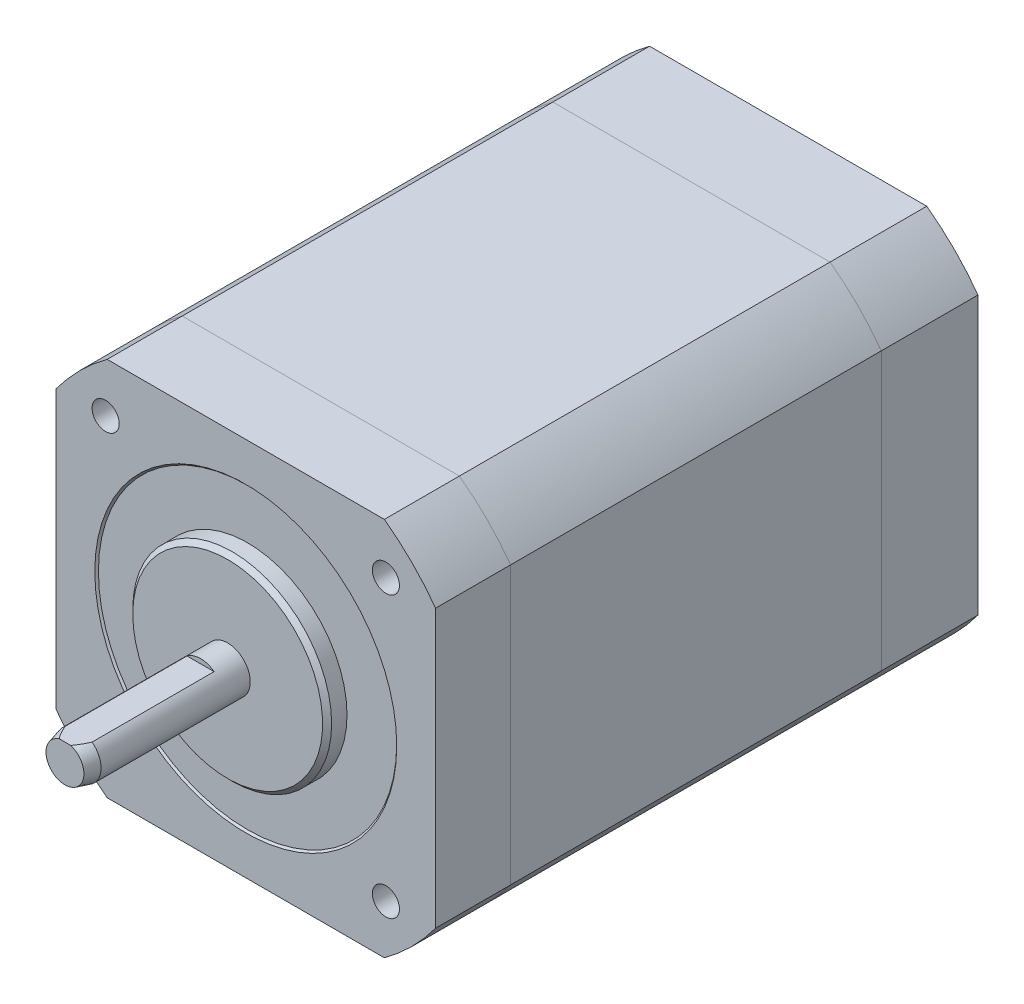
ISO-10303-21;
HEADER;
FILE_DESCRIPTION(('STEP AP214'),'2;1');
FILE_NAME('part.step','',(''),(''),'','','');
FILE_SCHEMA(('AUTOMOTIVE_DESIGN { 1 0 10303 214 1 1 1 1 }'));
ENDSEC;
DATA;
#1=APPLICATION_CONTEXT('core data for automotive mechanical design processes');
#2=APPLICATION_PROTOCOL_DEFINITION('international standard','automotive_design',2000,#1);
#3=PRODUCT_CONTEXT('',#1,'mechanical');
#4=PRODUCT('Part','Part','',(#3));
#5=PRODUCT_RELATED_PRODUCT_CATEGORY('part','',(#4));
#6=PRODUCT_DEFINITION_FORMATION('','',#4);
#7=PRODUCT_DEFINITION_CONTEXT('part definition',#1,'design');
#8=PRODUCT_DEFINITION('design','',#6,#7);
#9=PRODUCT_DEFINITION_SHAPE('','',#8);
#10=(LENGTH_UNIT() NAMED_UNIT(*) SI_UNIT(.MILLI.,.METRE.));
#11=(NAMED_UNIT(*) PLANE_ANGLE_UNIT() SI_UNIT($,.RADIAN.));
#12=(NAMED_UNIT(*) SI_UNIT($,.STERADIAN.) SOLID_ANGLE_UNIT());
#13=UNCERTAINTY_MEASURE_WITH_UNIT(LENGTH_MEASURE(1.E-05),#10,'distance_accuracy_value','');
#14=(GEOMETRIC_REPRESENTATION_CONTEXT(3) GLOBAL_UNCERTAINTY_ASSIGNED_CONTEXT((#13)) GLOBAL_UNIT_ASSIGNED_CONTEXT((#10,
#11,#12)) REPRESENTATION_CONTEXT('',''));
#15=CARTESIAN_POINT('',(0.,0.,0.));
#16=DIRECTION('',(0.,0.,1.));
#17=DIRECTION('',(1.,0.,0.));
#18=AXIS2_PLACEMENT_3D('',#15,#16,#17);
#19=CARTESIAN_POINT('',(-8.39999999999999,-25.6,-51.8));
#20=DIRECTION('',(1.,0.,0.));
#21=DIRECTION('',(0.,0.,-1.));
#22=AXIS2_PLACEMENT_3D('',#19,#20,#21);
#23=PLANE('',#22);
#24=DIRECTION('',(0.,0.,-1.));
#25=VECTOR('',#24,1.);
#26=CARTESIAN_POINT('',(-8.39999999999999,-21.,-51.8));
#27=LINE('',#26,#25);
#28=CARTESIAN_POINT('',(-8.39999999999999,-21.,-51.8));
#29=VERTEX_POINT('',#28);
#30=CARTESIAN_POINT('',(-8.39999999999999,-21.,-62.));
#31=VERTEX_POINT('',#30);
#32=EDGE_CURVE('E112',#29,#31,#27,.T.);
#33=ORIENTED_EDGE('',*,*,#32,.T.);
#34=DIRECTION('',(0.,1.,0.));
#35=VECTOR('',#34,1.);
#36=CARTESIAN_POINT('',(-8.39999999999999,-25.6,-62.));
#37=LINE('',#36,#35);
#38=CARTESIAN_POINT('',(-8.39999999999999,-25.6,-62.));
#39=VERTEX_POINT('',#38);
#40=EDGE_CURVE('E13',#39,#31,#37,.T.);
#41=ORIENTED_EDGE('',*,*,#40,.F.);
#42=DIRECTION('',(0.,0.,-1.));
#43=VECTOR('',#42,1.);
#44=CARTESIAN_POINT('',(-8.39999999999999,-25.6,-51.8));
#45=LINE('',#44,#43);
#46=CARTESIAN_POINT('',(-8.39999999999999,-25.6,-51.8));
#47=VERTEX_POINT('',#46);
#48=EDGE_CURVE('E100',#47,#39,#45,.T.);
#49=ORIENTED_EDGE('',*,*,#48,.F.);
#50=DIRECTION('',(0.,1.,0.));
#51=VECTOR('',#50,1.);
#52=CARTESIAN_POINT('',(-8.39999999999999,-25.6,-51.8));
#53=LINE('',#52,#51);
#54=EDGE_CURVE('E108',#47,#29,#53,.T.);
#55=ORIENTED_EDGE('',*,*,#54,.T.);
#56=EDGE_LOOP('',(#33,#41,#49,#55));
#57=FACE_BOUND('',#56,.T.);
#58=ADVANCED_FACE('F49',(#57),#23,.F.);
#59=CARTESIAN_POINT('',(-8.39999999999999,-25.6,-62.));
#60=DIRECTION('',(0.,0.,1.));
#61=DIRECTION('',(1.,0.,0.));
#62=AXIS2_PLACEMENT_3D('',#59,#60,#61);
#63=PLANE('',#62);
#64=DIRECTION('',(1.,0.,0.));
#65=VECTOR('',#64,1.);
#66=CARTESIAN_POINT('',(-8.39999999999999,-21.,-62.));
#67=LINE('',#66,#65);
#68=CARTESIAN_POINT('',(8.40000000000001,-21.,-62.));
#69=VERTEX_POINT('',#68);
#70=EDGE_CURVE('E104',#31,#69,#67,.T.);
#71=ORIENTED_EDGE('',*,*,#70,.T.);
#72=DIRECTION('',(0.,1.,0.));
#73=VECTOR('',#72,1.);
#74=CARTESIAN_POINT('',(8.40000000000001,-25.6,-62.));
#75=LINE('',#74,#73);
#76=CARTESIAN_POINT('',(8.40000000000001,-25.6,-62.));
#77=VERTEX_POINT('',#76);
#78=EDGE_CURVE('E57',#77,#69,#75,.T.);
#79=ORIENTED_EDGE('',*,*,#78,.F.);
#80=DIRECTION('',(1.,0.,0.));
#81=VECTOR('',#80,1.);
#82=CARTESIAN_POINT('',(-8.39999999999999,-25.6,-62.));
#83=LINE('',#82,#81);
#84=EDGE_CURVE('E95',#39,#77,#83,.T.);
#85=ORIENTED_EDGE('',*,*,#84,.F.);
#86=ORIENTED_EDGE('',*,*,#40,.T.);
#87=EDGE_LOOP('',(#71,#79,#85,#86));
#88=FACE_BOUND('',#87,.T.);
#89=ADVANCED_FACE('F103',(#88),#63,.F.);
#90=CARTESIAN_POINT('',(8.40000000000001,-25.6,-51.8));
#91=DIRECTION('',(-1.,0.,0.));
#92=DIRECTION('',(0.,-1.,0.));
#93=AXIS2_PLACEMENT_3D('',#90,#91,#92);
#94=PLANE('',#93);
#95=DIRECTION('',(0.,0.,1.));
#96=VECTOR('',#95,1.);
#97=CARTESIAN_POINT('',(8.40000000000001,-21.,-51.8));
#98=LINE('',#97,#96);
#99=CARTESIAN_POINT('',(8.40000000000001,-21.,-51.8));
#100=VERTEX_POINT('',#99);
#101=EDGE_CURVE('E82',#69,#100,#98,.T.);
#102=ORIENTED_EDGE('',*,*,#101,.T.);
#103=DIRECTION('',(0.,1.,0.));
#104=VECTOR('',#103,1.);
#105=CARTESIAN_POINT('',(8.40000000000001,-25.6,-51.8));
#106=LINE('',#105,#104);
#107=CARTESIAN_POINT('',(8.40000000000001,-25.6,-51.8));
#108=VERTEX_POINT('',#107);
#109=EDGE_CURVE('E105',#108,#100,#106,.T.);
#110=ORIENTED_EDGE('',*,*,#109,.F.);
#111=DIRECTION('',(0.,0.,1.));
#112=VECTOR('',#111,1.);
#113=CARTESIAN_POINT('',(8.40000000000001,-25.6,-51.8));
#114=LINE('',#113,#112);
#115=EDGE_CURVE('E98',#77,#108,#114,.T.);
#116=ORIENTED_EDGE('',*,*,#115,.F.);
#117=ORIENTED_EDGE('',*,*,#78,.T.);
#118=EDGE_LOOP('',(#102,#110,#116,#117));
#119=FACE_BOUND('',#118,.T.);
#120=ADVANCED_FACE('F106',(#119),#94,.F.);
#121=CARTESIAN_POINT('',(-8.39999999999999,-25.6,-51.8));
#122=DIRECTION('',(0.,0.,-1.));
#123=DIRECTION('',(-1.,0.,0.));
#124=AXIS2_PLACEMENT_3D('',#121,#122,#123);
#125=PLANE('',#124);
#126=DIRECTION('',(-1.,0.,0.));
#127=VECTOR('',#126,1.);
#128=CARTESIAN_POINT('',(-8.39999999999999,-21.,-51.8));
#129=LINE('',#128,#127);
#130=EDGE_CURVE('E88',#100,#29,#129,.T.);
#131=ORIENTED_EDGE('',*,*,#130,.T.);
#132=ORIENTED_EDGE('',*,*,#54,.F.);
#133=DIRECTION('',(-1.,0.,0.));
#134=VECTOR('',#133,1.);
#135=CARTESIAN_POINT('',(-8.39999999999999,-25.6,-51.8));
#136=LINE('',#135,#134);
#137=EDGE_CURVE('E65',#108,#47,#136,.T.);
#138=ORIENTED_EDGE('',*,*,#137,.F.);
#139=ORIENTED_EDGE('',*,*,#109,.T.);
#140=EDGE_LOOP('',(#131,#132,#138,#139));
#141=FACE_BOUND('',#140,.T.);
#142=ADVANCED_FACE('F119',(#141),#125,.F.);
#143=CARTESIAN_POINT('',(0.,-25.6,0.));
#144=DIRECTION('',(0.,-1.,0.));
#145=DIRECTION('',(0.,0.,-1.));
#146=AXIS2_PLACEMENT_3D('',#143,#144,#145);
#147=PLANE('',#146);
#148=ORIENTED_EDGE('',*,*,#48,.T.);
#149=ORIENTED_EDGE('',*,*,#84,.T.);
#150=ORIENTED_EDGE('',*,*,#115,.T.);
#151=ORIENTED_EDGE('',*,*,#137,.T.);
#152=EDGE_LOOP('',(#148,#149,#150,#151));
#153=FACE_BOUND('',#152,.T.);
#154=ADVANCED_FACE('F96',(#153),#147,.T.);
#155=CARTESIAN_POINT('',(0.,-21.,0.));
#156=DIRECTION('',(0.,-1.,0.));
#157=DIRECTION('',(0.,0.,-1.));
#158=AXIS2_PLACEMENT_3D('',#155,#156,#157);
#159=PLANE('',#158);
#160=ORIENTED_EDGE('',*,*,#32,.F.);
#161=ORIENTED_EDGE('',*,*,#130,.F.);
#162=ORIENTED_EDGE('',*,*,#101,.F.);
#163=ORIENTED_EDGE('',*,*,#70,.F.);
#164=EDGE_LOOP('',(#160,#161,#162,#163));
#165=FACE_BOUND('',#164,.T.);
#166=ADVANCED_FACE('F122',(#165),#159,.F.);
#167=CLOSED_SHELL('',(#58,#89,#120,#142,#154,#166));
#168=MANIFOLD_SOLID_BREP('B2',#167);
#169=CARTESIAN_POINT('',(0.,0.,-62.));
#170=DIRECTION('',(0.,0.,1.));
#171=DIRECTION('',(1.,0.,0.));
#172=AXIS2_PLACEMENT_3D('',#169,#170,#171);
#173=CYLINDRICAL_SURFACE('',#172,26.);
#174=CARTESIAN_POINT('',(0.,0.,-51.3));
#175=DIRECTION('',(0.,0.,-1.));
#176=DIRECTION('',(-1.,0.,0.));
#177=AXIS2_PLACEMENT_3D('',#174,#175,#176);
#178=CIRCLE('',#177,26.);
#179=CARTESIAN_POINT('',(21.,-15.3297097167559,-51.3));
#180=VERTEX_POINT('',#179);
#181=CARTESIAN_POINT('',(15.3297097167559,-21.,-51.3));
#182=VERTEX_POINT('',#181);
#183=EDGE_CURVE('E297',#180,#182,#178,.T.);
#184=ORIENTED_EDGE('',*,*,#183,.T.);
#185=DIRECTION('',(0.,0.,1.));
#186=VECTOR('',#185,1.);
#187=CARTESIAN_POINT('',(15.3297097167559,-21.,-62.));
#188=LINE('',#187,#186);
#189=CARTESIAN_POINT('',(15.3297097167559,-21.,-62.));
#190=VERTEX_POINT('',#189);
#191=EDGE_CURVE('E326',#190,#182,#188,.T.);
#192=ORIENTED_EDGE('',*,*,#191,.F.);
#193=CARTESIAN_POINT('',(0.,0.,-62.));
#194=DIRECTION('',(0.,0.,-1.));
#195=DIRECTION('',(-1.,0.,0.));
#196=AXIS2_PLACEMENT_3D('',#193,#194,#195);
#197=CIRCLE('',#196,26.);
#198=CARTESIAN_POINT('',(21.,-15.3297097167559,-62.));
#199=VERTEX_POINT('',#198);
#200=EDGE_CURVE('E313',#199,#190,#197,.T.);
#201=ORIENTED_EDGE('',*,*,#200,.F.);
#202=DIRECTION('',(0.,0.,1.));
#203=VECTOR('',#202,1.);
#204=CARTESIAN_POINT('',(21.,-15.3297097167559,-62.));
#205=LINE('',#204,#203);
#206=EDGE_CURVE('E293',#199,#180,#205,.T.);
#207=ORIENTED_EDGE('',*,*,#206,.T.);
#208=EDGE_LOOP('',(#184,#192,#201,#207));
#209=FACE_BOUND('',#208,.T.);
#210=ADVANCED_FACE('F183',(#209),#173,.T.);
#211=CARTESIAN_POINT('',(15.3297097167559,-21.,-62.));
#212=DIRECTION('',(0.,1.,0.));
#213=DIRECTION('',(-1.,0.,0.));
#214=AXIS2_PLACEMENT_3D('',#211,#212,#213);
#215=PLANE('',#214);
#216=DIRECTION('',(-1.,0.,0.));
#217=VECTOR('',#216,1.);
#218=CARTESIAN_POINT('',(15.3297097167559,-21.,-51.3));
#219=LINE('',#218,#217);
#220=CARTESIAN_POINT('',(-15.3297097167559,-21.,-51.3));
#221=VERTEX_POINT('',#220);
#222=EDGE_CURVE('E300',#182,#221,#219,.T.);
#223=ORIENTED_EDGE('',*,*,#222,.T.);
#224=DIRECTION('',(0.,0.,1.));
#225=VECTOR('',#224,1.);
#226=CARTESIAN_POINT('',(-15.3297097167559,-21.,-62.));
#227=LINE('',#226,#225);
#228=CARTESIAN_POINT('',(-15.3297097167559,-21.,-62.));
#229=VERTEX_POINT('',#228);
#230=EDGE_CURVE('E323',#229,#221,#227,.T.);
#231=ORIENTED_EDGE('',*,*,#230,.F.);
#232=DIRECTION('',(-1.,0.,0.));
#233=VECTOR('',#232,1.);
#234=CARTESIAN_POINT('',(15.3297097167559,-21.,-62.));
#235=LINE('',#234,#233);
#236=EDGE_CURVE('E254',#190,#229,#235,.T.);
#237=ORIENTED_EDGE('',*,*,#236,.F.);
#238=ORIENTED_EDGE('',*,*,#191,.T.);
#239=EDGE_LOOP('',(#223,#231,#237,#238));
#240=FACE_BOUND('',#239,.T.);
#241=ADVANCED_FACE('F385',(#240),#215,.F.);
#242=CARTESIAN_POINT('',(0.,0.,-62.));
#243=DIRECTION('',(0.,0.,1.));
#244=DIRECTION('',(1.,0.,0.));
#245=AXIS2_PLACEMENT_3D('',#242,#243,#244);
#246=CYLINDRICAL_SURFACE('',#245,26.);
#247=CARTESIAN_POINT('',(0.,0.,-51.3));
#248=DIRECTION('',(0.,0.,-1.));
#249=DIRECTION('',(-1.,0.,0.));
#250=AXIS2_PLACEMENT_3D('',#247,#248,#249);
#251=CIRCLE('',#250,26.);
#252=CARTESIAN_POINT('',(-21.,-15.3297097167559,-51.3));
#253=VERTEX_POINT('',#252);
#254=EDGE_CURVE('E303',#221,#253,#251,.T.);
#255=ORIENTED_EDGE('',*,*,#254,.T.);
#256=DIRECTION('',(0.,0.,1.));
#257=VECTOR('',#256,1.);
#258=CARTESIAN_POINT('',(-21.,-15.3297097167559,-62.));
#259=LINE('',#258,#257);
#260=CARTESIAN_POINT('',(-21.,-15.3297097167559,-62.));
#261=VERTEX_POINT('',#260);
#262=EDGE_CURVE('E320',#261,#253,#259,.T.);
#263=ORIENTED_EDGE('',*,*,#262,.F.);
#264=CARTESIAN_POINT('',(0.,0.,-62.));
#265=DIRECTION('',(0.,0.,-1.));
#266=DIRECTION('',(-1.,0.,0.));
#267=AXIS2_PLACEMENT_3D('',#264,#265,#266);
#268=CIRCLE('',#267,26.);
#269=EDGE_CURVE('E365',#229,#261,#268,.T.);
#270=ORIENTED_EDGE('',*,*,#269,.F.);
#271=ORIENTED_EDGE('',*,*,#230,.T.);
#272=EDGE_LOOP('',(#255,#263,#270,#271));
#273=FACE_BOUND('',#272,.T.);
#274=ADVANCED_FACE('F388',(#273),#246,.T.);
#275=CARTESIAN_POINT('',(-21.,-15.3297097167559,-62.));
#276=DIRECTION('',(1.,0.,0.));
#277=DIRECTION('',(0.,1.,0.));
#278=AXIS2_PLACEMENT_3D('',#275,#276,#277);
#279=PLANE('',#278);
#280=DIRECTION('',(0.,1.,0.));
#281=VECTOR('',#280,1.);
#282=CARTESIAN_POINT('',(-21.,-15.3297097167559,-51.3));
#283=LINE('',#282,#281);
#284=CARTESIAN_POINT('',(-21.,15.3297097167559,-51.3));
#285=VERTEX_POINT('',#284);
#286=EDGE_CURVE('E305',#253,#285,#283,.T.);
#287=ORIENTED_EDGE('',*,*,#286,.T.);
#288=DIRECTION('',(0.,0.,1.));
#289=VECTOR('',#288,1.);
#290=CARTESIAN_POINT('',(-21.,15.3297097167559,-62.));
#291=LINE('',#290,#289);
#292=CARTESIAN_POINT('',(-21.,15.3297097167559,-62.));
#293=VERTEX_POINT('',#292);
#294=EDGE_CURVE('E317',#293,#285,#291,.T.);
#295=ORIENTED_EDGE('',*,*,#294,.F.);
#296=DIRECTION('',(0.,1.,0.));
#297=VECTOR('',#296,1.);
#298=CARTESIAN_POINT('',(-21.,-15.3297097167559,-62.));
#299=LINE('',#298,#297);
#300=EDGE_CURVE('E367',#261,#293,#299,.T.);
#301=ORIENTED_EDGE('',*,*,#300,.F.);
#302=ORIENTED_EDGE('',*,*,#262,.T.);
#303=EDGE_LOOP('',(#287,#295,#301,#302));
#304=FACE_BOUND('',#303,.T.);
#305=ADVANCED_FACE('F373',(#304),#279,.F.);
#306=CARTESIAN_POINT('',(0.,0.,-62.));
#307=DIRECTION('',(0.,0.,1.));
#308=DIRECTION('',(1.,0.,0.));
#309=AXIS2_PLACEMENT_3D('',#306,#307,#308);
#310=CYLINDRICAL_SURFACE('',#309,26.);
#311=CARTESIAN_POINT('',(0.,0.,-51.3));
#312=DIRECTION('',(0.,0.,-1.));
#313=DIRECTION('',(-1.,0.,0.));
#314=AXIS2_PLACEMENT_3D('',#311,#312,#313);
#315=CIRCLE('',#314,26.);
#316=CARTESIAN_POINT('',(-15.3297097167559,21.,-51.3));
#317=VERTEX_POINT('',#316);
#318=EDGE_CURVE('E307',#285,#317,#315,.T.);
#319=ORIENTED_EDGE('',*,*,#318,.T.);
#320=DIRECTION('',(0.,0.,1.));
#321=VECTOR('',#320,1.);
#322=CARTESIAN_POINT('',(-15.3297097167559,21.,-62.));
#323=LINE('',#322,#321);
#324=CARTESIAN_POINT('',(-15.3297097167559,21.,-62.));
#325=VERTEX_POINT('',#324);
#326=EDGE_CURVE('E288',#325,#317,#323,.T.);
#327=ORIENTED_EDGE('',*,*,#326,.F.);
#328=CARTESIAN_POINT('',(0.,0.,-62.));
#329=DIRECTION('',(0.,0.,-1.));
#330=DIRECTION('',(-1.,0.,0.));
#331=AXIS2_PLACEMENT_3D('',#328,#329,#330);
#332=CIRCLE('',#331,26.);
#333=EDGE_CURVE('E276',#293,#325,#332,.T.);
#334=ORIENTED_EDGE('',*,*,#333,.F.);
#335=ORIENTED_EDGE('',*,*,#294,.T.);
#336=EDGE_LOOP('',(#319,#327,#334,#335));
#337=FACE_BOUND('',#336,.T.);
#338=ADVANCED_FACE('F377',(#337),#310,.T.);
#339=CARTESIAN_POINT('',(-15.3297097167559,21.,-62.));
#340=DIRECTION('',(0.,-1.,0.));
#341=DIRECTION('',(0.,0.,-1.));
#342=AXIS2_PLACEMENT_3D('',#339,#340,#341);
#343=PLANE('',#342);
#344=DIRECTION('',(1.,0.,0.));
#345=VECTOR('',#344,1.);
#346=CARTESIAN_POINT('',(-15.3297097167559,21.,-51.3));
#347=LINE('',#346,#345);
#348=CARTESIAN_POINT('',(15.3297097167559,21.,-51.3));
#349=VERTEX_POINT('',#348);
#350=EDGE_CURVE('E285',#317,#349,#347,.T.);
#351=ORIENTED_EDGE('',*,*,#350,.T.);
#352=DIRECTION('',(0.,0.,1.));
#353=VECTOR('',#352,1.);
#354=CARTESIAN_POINT('',(15.3297097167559,21.,-62.));
#355=LINE('',#354,#353);
#356=CARTESIAN_POINT('',(15.3297097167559,21.,-62.));
#357=VERTEX_POINT('',#356);
#358=EDGE_CURVE('E282',#357,#349,#355,.T.);
#359=ORIENTED_EDGE('',*,*,#358,.F.);
#360=DIRECTION('',(1.,0.,0.));
#361=VECTOR('',#360,1.);
#362=CARTESIAN_POINT('',(-15.3297097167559,21.,-62.));
#363=LINE('',#362,#361);
#364=EDGE_CURVE('E269',#325,#357,#363,.T.);
#365=ORIENTED_EDGE('',*,*,#364,.F.);
#366=ORIENTED_EDGE('',*,*,#326,.T.);
#367=EDGE_LOOP('',(#351,#359,#365,#366));
#368=FACE_BOUND('',#367,.T.);
#369=ADVANCED_FACE('F283',(#368),#343,.F.);
#370=CARTESIAN_POINT('',(0.,0.,-62.));
#371=DIRECTION('',(0.,0.,1.));
#372=DIRECTION('',(1.,0.,0.));
#373=AXIS2_PLACEMENT_3D('',#370,#371,#372);
#374=CYLINDRICAL_SURFACE('',#373,26.);
#375=CARTESIAN_POINT('',(0.,0.,-51.3));
#376=DIRECTION('',(0.,0.,-1.));
#377=DIRECTION('',(-1.,0.,0.));
#378=AXIS2_PLACEMENT_3D('',#375,#376,#377);
#379=CIRCLE('',#378,26.);
#380=CARTESIAN_POINT('',(21.,15.3297097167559,-51.3));
#381=VERTEX_POINT('',#380);
#382=EDGE_CURVE('E310',#349,#381,#379,.T.);
#383=ORIENTED_EDGE('',*,*,#382,.T.);
#384=DIRECTION('',(0.,0.,1.));
#385=VECTOR('',#384,1.);
#386=CARTESIAN_POINT('',(21.,15.3297097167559,-62.));
#387=LINE('',#386,#385);
#388=CARTESIAN_POINT('',(21.,15.3297097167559,-62.));
#389=VERTEX_POINT('',#388);
#390=EDGE_CURVE('E289',#389,#381,#387,.T.);
#391=ORIENTED_EDGE('',*,*,#390,.F.);
#392=CARTESIAN_POINT('',(0.,0.,-62.));
#393=DIRECTION('',(0.,0.,-1.));
#394=DIRECTION('',(-1.,0.,0.));
#395=AXIS2_PLACEMENT_3D('',#392,#393,#394);
#396=CIRCLE('',#395,26.);
#397=EDGE_CURVE('E273',#357,#389,#396,.T.);
#398=ORIENTED_EDGE('',*,*,#397,.F.);
#399=ORIENTED_EDGE('',*,*,#358,.T.);
#400=EDGE_LOOP('',(#383,#391,#398,#399));
#401=FACE_BOUND('',#400,.T.);
#402=ADVANCED_FACE('F291',(#401),#374,.T.);
#403=CARTESIAN_POINT('',(21.,15.3297097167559,-62.));
#404=DIRECTION('',(-1.,0.,0.));
#405=DIRECTION('',(0.,-1.,0.));
#406=AXIS2_PLACEMENT_3D('',#403,#404,#405);
#407=PLANE('',#406);
#408=DIRECTION('',(0.,-1.,0.));
#409=VECTOR('',#408,1.);
#410=CARTESIAN_POINT('',(21.,15.3297097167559,-51.3));
#411=LINE('',#410,#409);
#412=EDGE_CURVE('E245',#381,#180,#411,.T.);
#413=ORIENTED_EDGE('',*,*,#412,.T.);
#414=ORIENTED_EDGE('',*,*,#206,.F.);
#415=DIRECTION('',(0.,-1.,0.));
#416=VECTOR('',#415,1.);
#417=CARTESIAN_POINT('',(21.,15.3297097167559,-62.));
#418=LINE('',#417,#416);
#419=EDGE_CURVE('E212',#389,#199,#418,.T.);
#420=ORIENTED_EDGE('',*,*,#419,.F.);
#421=ORIENTED_EDGE('',*,*,#390,.T.);
#422=EDGE_LOOP('',(#413,#414,#420,#421));
#423=FACE_BOUND('',#422,.T.);
#424=ADVANCED_FACE('F381',(#423),#407,.F.);
#425=CARTESIAN_POINT('',(0.,0.,-62.));
#426=DIRECTION('',(0.,0.,-1.));
#427=DIRECTION('',(-1.,0.,0.));
#428=AXIS2_PLACEMENT_3D('',#425,#426,#427);
#429=PLANE('',#428);
#430=CARTESIAN_POINT('',(0.,0.,-62.));
#431=DIRECTION('',(0.,0.,-1.));
#432=DIRECTION('',(-1.,0.,0.));
#433=AXIS2_PLACEMENT_3D('',#430,#431,#432);
#434=CIRCLE('',#433,2.5);
#435=CARTESIAN_POINT('',(1.5,2.,-62.));
#436=VERTEX_POINT('',#435);
#437=CARTESIAN_POINT('',(-1.5,2.,-62.));
#438=VERTEX_POINT('',#437);
#439=EDGE_CURVE('E301',#436,#438,#434,.T.);
#440=ORIENTED_EDGE('',*,*,#439,.F.);
#441=DIRECTION('',(-1.,0.,0.));
#442=VECTOR('',#441,1.);
#443=CARTESIAN_POINT('',(5.96961507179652,2.,-62.));
#444=LINE('',#443,#442);
#445=EDGE_CURVE('E349',#436,#438,#444,.T.);
#446=ORIENTED_EDGE('',*,*,#445,.T.);
#447=EDGE_LOOP('',(#440,#446));
#448=FACE_BOUND('',#447,.T.);
#449=ORIENTED_EDGE('',*,*,#200,.T.);
#450=ORIENTED_EDGE('',*,*,#236,.T.);
#451=ORIENTED_EDGE('',*,*,#269,.T.);
#452=ORIENTED_EDGE('',*,*,#300,.T.);
#453=ORIENTED_EDGE('',*,*,#333,.T.);
#454=ORIENTED_EDGE('',*,*,#364,.T.);
#455=ORIENTED_EDGE('',*,*,#397,.T.);
#456=ORIENTED_EDGE('',*,*,#419,.T.);
#457=EDGE_LOOP('',(#449,#450,#451,#452,#453,#454,#455,#456));
#458=FACE_BOUND('',#457,.T.);
#459=ADVANCED_FACE('F271',(#448,#458),#429,.T.);
#460=CARTESIAN_POINT('',(0.,0.,-51.3));
#461=DIRECTION('',(0.,0.,-1.));
#462=DIRECTION('',(-1.,0.,0.));
#463=AXIS2_PLACEMENT_3D('',#460,#461,#462);
#464=PLANE('',#463);
#465=ORIENTED_EDGE('',*,*,#183,.F.);
#466=ORIENTED_EDGE('',*,*,#412,.F.);
#467=ORIENTED_EDGE('',*,*,#382,.F.);
#468=ORIENTED_EDGE('',*,*,#350,.F.);
#469=ORIENTED_EDGE('',*,*,#318,.F.);
#470=ORIENTED_EDGE('',*,*,#286,.F.);
#471=ORIENTED_EDGE('',*,*,#254,.F.);
#472=ORIENTED_EDGE('',*,*,#222,.F.);
#473=EDGE_LOOP('',(#465,#466,#467,#468,#469,#470,#471,#472));
#474=FACE_BOUND('',#473,.T.);
#475=ADVANCED_FACE('F380',(#474),#464,.F.);
#476=CARTESIAN_POINT('',(0.,0.,-77.));
#477=DIRECTION('',(0.,0.,1.));
#478=DIRECTION('',(1.,0.,0.));
#479=AXIS2_PLACEMENT_3D('',#476,#477,#478);
#480=CYLINDRICAL_SURFACE('',#479,2.5);
#481=CARTESIAN_POINT('',(0.,0.,-75.4999999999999));
#482=DIRECTION('',(0.,0.,-1.));
#483=DIRECTION('',(-1.,0.,0.));
#484=AXIS2_PLACEMENT_3D('',#481,#482,#483);
#485=CIRCLE('',#484,2.5);
#486=CARTESIAN_POINT('',(-1.5,2.,-75.4999999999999));
#487=VERTEX_POINT('',#486);
#488=CARTESIAN_POINT('',(1.49999999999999,2.,-75.4999999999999));
#489=VERTEX_POINT('',#488);
#490=EDGE_CURVE('E330',#487,#489,#485,.F.);
#491=ORIENTED_EDGE('',*,*,#490,.T.);
#492=DIRECTION('',(0.,0.,1.));
#493=VECTOR('',#492,1.);
#494=CARTESIAN_POINT('',(1.5,2.,-77.));
#495=LINE('',#494,#493);
#496=EDGE_CURVE('E348',#489,#436,#495,.T.);
#497=ORIENTED_EDGE('',*,*,#496,.T.);
#498=ORIENTED_EDGE('',*,*,#439,.T.);
#499=DIRECTION('',(0.,0.,1.));
#500=VECTOR('',#499,1.);
#501=CARTESIAN_POINT('',(-1.5,2.,-77.));
#502=LINE('',#501,#500);
#503=EDGE_CURVE('E341',#438,#487,#502,.F.);
#504=ORIENTED_EDGE('',*,*,#503,.T.);
#505=EDGE_LOOP('',(#491,#497,#498,#504));
#506=FACE_BOUND('',#505,.T.);
#507=ADVANCED_FACE('F346',(#506),#480,.T.);
#508=CARTESIAN_POINT('',(0.,0.,-77.));
#509=DIRECTION('',(0.,0.,-1.));
#510=DIRECTION('',(-1.,0.,0.));
#511=AXIS2_PLACEMENT_3D('',#508,#509,#510);
#512=PLANE('',#511);
#513=DIRECTION('',(-1.,0.,0.));
#514=VECTOR('',#513,1.);
#515=CARTESIAN_POINT('',(5.96961507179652,2.,-77.));
#516=LINE('',#515,#514);
#517=CARTESIAN_POINT('',(0.633974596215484,2.,-77.));
#518=VERTEX_POINT('',#517);
#519=CARTESIAN_POINT('',(-0.633974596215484,2.,-77.));
#520=VERTEX_POINT('',#519);
#521=EDGE_CURVE('E203',#518,#520,#516,.T.);
#522=ORIENTED_EDGE('',*,*,#521,.F.);
#523=CARTESIAN_POINT('',(0.,0.,-77.));
#524=DIRECTION('',(0.,0.,-1.));
#525=DIRECTION('',(-1.,0.,0.));
#526=AXIS2_PLACEMENT_3D('',#523,#524,#525);
#527=CIRCLE('',#526,2.09807621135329);
#528=EDGE_CURVE('E328',#518,#520,#527,.T.);
#529=ORIENTED_EDGE('',*,*,#528,.T.);
#530=EDGE_LOOP('',(#522,#529));
#531=FACE_BOUND('',#530,.T.);
#532=ADVANCED_FACE('F357',(#531),#512,.T.);
#533=CARTESIAN_POINT('',(0.,0.,-77.));
#534=DIRECTION('',(0.,0.,1.));
#535=DIRECTION('',(1.,0.,0.));
#536=AXIS2_PLACEMENT_3D('',#533,#534,#535);
#537=CONICAL_SURFACE('',#536,2.09807621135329,0.261799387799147);
#538=CARTESIAN_POINT('',(2.67411513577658,2.,-72.3677080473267));
#539=CARTESIAN_POINT('',(2.63311786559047,2.,-72.4902257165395));
#540=CARTESIAN_POINT('',(2.5918216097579,2.,-72.6126436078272));
#541=CARTESIAN_POINT('',(2.50853023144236,2.,-72.8572444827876));
#542=CARTESIAN_POINT('',(2.46653509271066,2.,-72.9794274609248));
#543=CARTESIAN_POINT('',(2.33928264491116,2.,-73.34576464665));
#544=CARTESIAN_POINT('',(2.25282589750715,2.,-73.5895039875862));
#545=CARTESIAN_POINT('',(2.07457613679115,2.,-74.0781045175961));
#546=CARTESIAN_POINT('',(1.9827345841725,2.,-74.3229481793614));
#547=CARTESIAN_POINT('',(1.84011140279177,2.,-74.6882620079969));
#548=CARTESIAN_POINT('',(1.79177038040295,2.,-74.8096838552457));
#549=CARTESIAN_POINT('',(1.69305456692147,2.,-75.0516959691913));
#550=CARTESIAN_POINT('',(1.64267985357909,2.,-75.1722862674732));
#551=CARTESIAN_POINT('',(1.53950262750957,2.,-75.4120087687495));
#552=CARTESIAN_POINT('',(1.48670769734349,2.,-75.5311442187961));
#553=CARTESIAN_POINT('',(1.37773401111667,2.,-75.7679408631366));
#554=CARTESIAN_POINT('',(1.32155357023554,2.,-75.8856012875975));
#555=CARTESIAN_POINT('',(1.20458285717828,2.,-76.1187131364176));
#556=CARTESIAN_POINT('',(1.14379017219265,2.,-76.2341633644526));
#557=CARTESIAN_POINT('',(1.01570284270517,2.,-76.4612984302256));
#558=CARTESIAN_POINT('',(0.948415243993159,2.,-76.5729871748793));
#559=CARTESIAN_POINT('',(0.817363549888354,2.,-76.7692701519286));
#560=CARTESIAN_POINT('',(0.755348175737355,2.,-76.8549879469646));
#561=CARTESIAN_POINT('',(0.654778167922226,2.,-76.9770588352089));
#562=CARTESIAN_POINT('',(0.62009408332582,2.,-77.0165731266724));
#563=CARTESIAN_POINT('',(0.547506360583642,2.,-77.0924930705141));
#564=CARTESIAN_POINT('',(0.509607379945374,2.,-77.1289030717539));
#565=CARTESIAN_POINT('',(0.439829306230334,2.,-77.1884315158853));
#566=CARTESIAN_POINT('',(0.408844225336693,2.,-77.2125855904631));
#567=CARTESIAN_POINT('',(0.344218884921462,2.,-77.2572111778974));
#568=CARTESIAN_POINT('',(0.310575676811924,2.,-77.2776785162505));
#569=CARTESIAN_POINT('',(0.24001236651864,2.,-77.3136158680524));
#570=CARTESIAN_POINT('',(0.203051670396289,2.,-77.3290087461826));
#571=CARTESIAN_POINT('',(0.126881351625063,2.,-77.3523462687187));
#572=CARTESIAN_POINT('',(0.0876800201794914,2.,-77.3603166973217));
#573=CARTESIAN_POINT('',(0.0127311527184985,2.,-77.367039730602));
#574=CARTESIAN_POINT('',(-0.022934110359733,2.,-77.3666919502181));
#575=CARTESIAN_POINT('',(-0.0935290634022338,2.,-77.3590326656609));
#576=CARTESIAN_POINT('',(-0.128457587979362,2.,-77.3517108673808));
#577=CARTESIAN_POINT('',(-0.201815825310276,2.,-77.329553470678));
#578=CARTESIAN_POINT('',(-0.23993504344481,2.,-77.3137192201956));
#579=CARTESIAN_POINT('',(-0.313185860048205,2.,-77.2762831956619));
#580=CARTESIAN_POINT('',(-0.348311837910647,2.,-77.2546708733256));
#581=CARTESIAN_POINT('',(-0.443923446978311,2.,-77.1877621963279));
#582=CARTESIAN_POINT('',(-0.501075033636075,2.,-77.1377652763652));
#583=CARTESIAN_POINT('',(-0.581429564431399,2.,-77.0575943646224));
#584=CARTESIAN_POINT('',(-0.607372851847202,2.,-77.0299378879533));
#585=CARTESIAN_POINT('',(-0.657731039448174,2.,-76.9732675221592));
#586=CARTESIAN_POINT('',(-0.682146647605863,2.,-76.9442542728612));
#587=CARTESIAN_POINT('',(-0.749893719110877,2.,-76.8601101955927));
#588=CARTESIAN_POINT('',(-0.791668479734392,2.,-76.8037362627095));
#589=CARTESIAN_POINT('',(-0.871939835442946,2.,-76.6886841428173));
#590=CARTESIAN_POINT('',(-0.910434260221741,2.,-76.6300044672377));
#591=CARTESIAN_POINT('',(-0.98494977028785,2.,-76.510925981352));
#592=CARTESIAN_POINT('',(-1.02096523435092,2.,-76.4505236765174));
#593=CARTESIAN_POINT('',(-1.09096213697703,2.,-76.3285472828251));
#594=CARTESIAN_POINT('',(-1.12494324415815,2.,-76.2669730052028));
#595=CARTESIAN_POINT('',(-1.22495399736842,2.,-76.0799665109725));
#596=CARTESIAN_POINT('',(-1.28847862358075,2.,-75.9531970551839));
#597=CARTESIAN_POINT('',(-1.4108548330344,2.,-75.6976781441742));
#598=CARTESIAN_POINT('',(-1.4697128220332,2.,-75.5689317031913));
#599=CARTESIAN_POINT('',(-1.58310001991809,2.,-75.312146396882));
#600=CARTESIAN_POINT('',(-1.63768554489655,2.,-75.184132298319));
#601=CARTESIAN_POINT('',(-1.74436311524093,2.,-74.9270663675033));
#602=CARTESIAN_POINT('',(-1.79645500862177,2.,-74.7980144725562));
#603=CARTESIAN_POINT('',(-1.94989108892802,2.,-74.4094944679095));
#604=CARTESIAN_POINT('',(-2.04830566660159,2.,-74.1488712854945));
#605=CARTESIAN_POINT('',(-2.23648040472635,2.,-73.6352664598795));
#606=CARTESIAN_POINT('',(-2.32642514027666,2.,-73.382351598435));
#607=CARTESIAN_POINT('',(-2.45867006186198,2.,-73.0022493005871));
#608=CARTESIAN_POINT('',(-2.50227709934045,2.,-72.8755147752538));
#609=CARTESIAN_POINT('',(-2.58873482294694,2.,-72.621791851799));
#610=CARTESIAN_POINT('',(-2.6315855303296,2.,-72.4948034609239));
#611=CARTESIAN_POINT('',(-2.67411513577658,2.,-72.3677080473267));
#612=B_SPLINE_CURVE_WITH_KNOTS('',3,(#538,#539,#540,#541,#542,#543,#544,#545,#546,#547,#548,
#549,#550,#551,#552,#553,#554,#555,#556,#557,#558,#559,#560,#561,#562,#563,#564,#565,#566,#567,
#568,#569,#570,#571,#572,#573,#574,#575,#576,#577,#578,#579,#580,#581,#582,#583,#584,#585,#586,
#587,#588,#589,#590,#591,#592,#593,#594,#595,#596,#597,#598,#599,#600,#601,#602,#603,#604,#605,
#606,#607,#608,#609,#610,#611),.UNSPECIFIED.,.F.,.F.,(4,2,2,2,2,2,2,2,2,2,2,2,2,2,2,2,2,2,2,2,2,
2,2,2,2,2,2,2,2,2,2,2,2,2,2,2,4),(0.,0.387584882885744,0.77517878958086,1.55100876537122,
2.33544116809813,2.7275001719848,3.11954420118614,3.51043426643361,3.90152049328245,
4.29281273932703,4.68368517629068,5.00048531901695,5.1580909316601,5.31547199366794,
5.4331414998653,5.55094341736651,5.67046127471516,5.78956238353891,5.89584731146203,
6.00228936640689,6.12543181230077,6.24880061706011,6.47525140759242,6.58900607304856,
6.70270762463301,6.91302983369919,7.12349013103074,7.33441292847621,7.54536999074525,
7.97059745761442,8.39523074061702,8.81269313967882,9.23018095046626,10.0658395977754,
10.8711084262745,11.2731870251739,11.6752543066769),.UNSPECIFIED.);
#613=EDGE_CURVE('E47',#489,#518,#612,.T.);
#614=ORIENTED_EDGE('',*,*,#613,.F.);
#615=ORIENTED_EDGE('',*,*,#490,.F.);
#616=EDGE_CURVE('E188',#520,#487,#612,.T.);
#617=ORIENTED_EDGE('',*,*,#616,.F.);
#618=ORIENTED_EDGE('',*,*,#528,.F.);
#619=EDGE_LOOP('',(#614,#615,#617,#618));
#620=FACE_BOUND('',#619,.T.);
#621=ADVANCED_FACE('F185',(#620),#537,.T.);
#622=CARTESIAN_POINT('',(5.96961507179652,2.,-62.));
#623=DIRECTION('',(0.,-1.,0.));
#624=DIRECTION('',(0.,0.,-1.));
#625=AXIS2_PLACEMENT_3D('',#622,#623,#624);
#626=PLANE('',#625);
#627=ORIENTED_EDGE('',*,*,#613,.T.);
#628=ORIENTED_EDGE('',*,*,#521,.T.);
#629=ORIENTED_EDGE('',*,*,#616,.T.);
#630=ORIENTED_EDGE('',*,*,#503,.F.);
#631=ORIENTED_EDGE('',*,*,#445,.F.);
#632=ORIENTED_EDGE('',*,*,#496,.F.);
#633=EDGE_LOOP('',(#627,#628,#629,#630,#631,#632));
#634=FACE_BOUND('',#633,.T.);
#635=ADVANCED_FACE('F338',(#634),#626,.F.);
#636=CLOSED_SHELL('',(#210,#241,#274,#305,#338,#369,#402,#424,#459,#475,#507,#532,#621,#635));
#637=MANIFOLD_SOLID_BREP('B7',#636);
#638=CARTESIAN_POINT('',(0.,0.,-51.3));
#639=DIRECTION('',(0.,0.,1.));
#640=DIRECTION('',(1.,0.,0.));
#641=AXIS2_PLACEMENT_3D('',#638,#639,#640);
#642=CYLINDRICAL_SURFACE('',#641,26.);
#643=CARTESIAN_POINT('',(0.,0.,-10.3));
#644=DIRECTION('',(0.,0.,-1.));
#645=DIRECTION('',(-1.,0.,0.));
#646=AXIS2_PLACEMENT_3D('',#643,#644,#645);
#647=CIRCLE('',#646,26.);
#648=CARTESIAN_POINT('',(21.,-15.3297097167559,-10.3));
#649=VERTEX_POINT('',#648);
#650=CARTESIAN_POINT('',(15.3297097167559,-21.,-10.3));
#651=VERTEX_POINT('',#650);
#652=EDGE_CURVE('E613',#649,#651,#647,.T.);
#653=ORIENTED_EDGE('',*,*,#652,.T.);
#654=DIRECTION('',(0.,0.,1.));
#655=VECTOR('',#654,1.);
#656=CARTESIAN_POINT('',(15.3297097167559,-21.,-51.3));
#657=LINE('',#656,#655);
#658=CARTESIAN_POINT('',(15.3297097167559,-21.,-51.3));
#659=VERTEX_POINT('',#658);
#660=EDGE_CURVE('E181',#659,#651,#657,.T.);
#661=ORIENTED_EDGE('',*,*,#660,.F.);
#662=CARTESIAN_POINT('',(0.,0.,-51.3));
#663=DIRECTION('',(0.,0.,-1.));
#664=DIRECTION('',(-1.,0.,0.));
#665=AXIS2_PLACEMENT_3D('',#662,#663,#664);
#666=CIRCLE('',#665,26.);
#667=CARTESIAN_POINT('',(21.,-15.3297097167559,-51.3));
#668=VERTEX_POINT('',#667);
#669=EDGE_CURVE('E627',#668,#659,#666,.T.);
#670=ORIENTED_EDGE('',*,*,#669,.F.);
#671=DIRECTION('',(0.,0.,1.));
#672=VECTOR('',#671,1.);
#673=CARTESIAN_POINT('',(21.,-15.3297097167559,-51.3));
#674=LINE('',#673,#672);
#675=EDGE_CURVE('E609',#668,#649,#674,.T.);
#676=ORIENTED_EDGE('',*,*,#675,.T.);
#677=EDGE_LOOP('',(#653,#661,#670,#676));
#678=FACE_BOUND('',#677,.T.);
#679=ADVANCED_FACE('F517',(#678),#642,.T.);
#680=CARTESIAN_POINT('',(15.3297097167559,-21.,-51.3));
#681=DIRECTION('',(0.,1.,0.));
#682=DIRECTION('',(0.,0.,1.));
#683=AXIS2_PLACEMENT_3D('',#680,#681,#682);
#684=PLANE('',#683);
#685=DIRECTION('',(-1.,0.,0.));
#686=VECTOR('',#685,1.);
#687=CARTESIAN_POINT('',(15.3297097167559,-21.,-10.3));
#688=LINE('',#687,#686);
#689=CARTESIAN_POINT('',(-15.3297097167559,-21.,-10.3));
#690=VERTEX_POINT('',#689);
#691=EDGE_CURVE('E616',#651,#690,#688,.T.);
#692=ORIENTED_EDGE('',*,*,#691,.T.);
#693=DIRECTION('',(0.,0.,1.));
#694=VECTOR('',#693,1.);
#695=CARTESIAN_POINT('',(-15.3297097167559,-21.,-51.3));
#696=LINE('',#695,#694);
#697=CARTESIAN_POINT('',(-15.3297097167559,-21.,-51.3));
#698=VERTEX_POINT('',#697);
#699=EDGE_CURVE('E525',#698,#690,#696,.T.);
#700=ORIENTED_EDGE('',*,*,#699,.F.);
#701=DIRECTION('',(-1.,0.,0.));
#702=VECTOR('',#701,1.);
#703=CARTESIAN_POINT('',(15.3297097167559,-21.,-51.3));
#704=LINE('',#703,#702);
#705=EDGE_CURVE('E576',#659,#698,#704,.T.);
#706=ORIENTED_EDGE('',*,*,#705,.F.);
#707=ORIENTED_EDGE('',*,*,#660,.T.);
#708=EDGE_LOOP('',(#692,#700,#706,#707));
#709=FACE_BOUND('',#708,.T.);
#710=ADVANCED_FACE('F662',(#709),#684,.F.);
#711=CARTESIAN_POINT('',(0.,0.,-51.3));
#712=DIRECTION('',(0.,0.,1.));
#713=DIRECTION('',(1.,0.,0.));
#714=AXIS2_PLACEMENT_3D('',#711,#712,#713);
#715=CYLINDRICAL_SURFACE('',#714,26.);
#716=CARTESIAN_POINT('',(0.,0.,-10.3));
#717=DIRECTION('',(0.,0.,-1.));
#718=DIRECTION('',(-1.,0.,0.));
#719=AXIS2_PLACEMENT_3D('',#716,#717,#718);
#720=CIRCLE('',#719,26.);
#721=CARTESIAN_POINT('',(-21.,-15.3297097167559,-10.3));
#722=VERTEX_POINT('',#721);
#723=EDGE_CURVE('E618',#690,#722,#720,.T.);
#724=ORIENTED_EDGE('',*,*,#723,.T.);
#725=DIRECTION('',(0.,0.,1.));
#726=VECTOR('',#725,1.);
#727=CARTESIAN_POINT('',(-21.,-15.3297097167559,-51.3));
#728=LINE('',#727,#726);
#729=CARTESIAN_POINT('',(-21.,-15.3297097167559,-51.3));
#730=VERTEX_POINT('',#729);
#731=EDGE_CURVE('E634',#730,#722,#728,.T.);
#732=ORIENTED_EDGE('',*,*,#731,.F.);
#733=CARTESIAN_POINT('',(0.,0.,-51.3));
#734=DIRECTION('',(0.,0.,-1.));
#735=DIRECTION('',(-1.,0.,0.));
#736=AXIS2_PLACEMENT_3D('',#733,#734,#735);
#737=CIRCLE('',#736,26.);
#738=EDGE_CURVE('E642',#698,#730,#737,.T.);
#739=ORIENTED_EDGE('',*,*,#738,.F.);
#740=ORIENTED_EDGE('',*,*,#699,.T.);
#741=EDGE_LOOP('',(#724,#732,#739,#740));
#742=FACE_BOUND('',#741,.T.);
#743=ADVANCED_FACE('F640',(#742),#715,.T.);
#744=CARTESIAN_POINT('',(-21.,-15.3297097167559,-51.3));
#745=DIRECTION('',(1.,0.,0.));
#746=DIRECTION('',(0.,0.,-1.));
#747=AXIS2_PLACEMENT_3D('',#744,#745,#746);
#748=PLANE('',#747);
#749=DIRECTION('',(0.,1.,0.));
#750=VECTOR('',#749,1.);
#751=CARTESIAN_POINT('',(-21.,-15.3297097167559,-10.3));
#752=LINE('',#751,#750);
#753=CARTESIAN_POINT('',(-21.,15.3297097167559,-10.3));
#754=VERTEX_POINT('',#753);
#755=EDGE_CURVE('E620',#722,#754,#752,.T.);
#756=ORIENTED_EDGE('',*,*,#755,.T.);
#757=DIRECTION('',(0.,0.,1.));
#758=VECTOR('',#757,1.);
#759=CARTESIAN_POINT('',(-21.,15.3297097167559,-51.3));
#760=LINE('',#759,#758);
#761=CARTESIAN_POINT('',(-21.,15.3297097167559,-51.3));
#762=VERTEX_POINT('',#761);
#763=EDGE_CURVE('E631',#762,#754,#760,.T.);
#764=ORIENTED_EDGE('',*,*,#763,.F.);
#765=DIRECTION('',(0.,1.,0.));
#766=VECTOR('',#765,1.);
#767=CARTESIAN_POINT('',(-21.,-15.3297097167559,-51.3));
#768=LINE('',#767,#766);
#769=EDGE_CURVE('E654',#730,#762,#768,.T.);
#770=ORIENTED_EDGE('',*,*,#769,.F.);
#771=ORIENTED_EDGE('',*,*,#731,.T.);
#772=EDGE_LOOP('',(#756,#764,#770,#771));
#773=FACE_BOUND('',#772,.T.);
#774=ADVANCED_FACE('F650',(#773),#748,.F.);
#775=CARTESIAN_POINT('',(0.,0.,-51.3));
#776=DIRECTION('',(0.,0.,1.));
#777=DIRECTION('',(1.,0.,0.));
#778=AXIS2_PLACEMENT_3D('',#775,#776,#777);
#779=CYLINDRICAL_SURFACE('',#778,26.);
#780=CARTESIAN_POINT('',(0.,0.,-10.3));
#781=DIRECTION('',(0.,0.,-1.));
#782=DIRECTION('',(-1.,0.,0.));
#783=AXIS2_PLACEMENT_3D('',#780,#781,#782);
#784=CIRCLE('',#783,26.);
#785=CARTESIAN_POINT('',(-15.3297097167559,21.,-10.3));
#786=VERTEX_POINT('',#785);
#787=EDGE_CURVE('E622',#754,#786,#784,.T.);
#788=ORIENTED_EDGE('',*,*,#787,.T.);
#789=DIRECTION('',(0.,0.,1.));
#790=VECTOR('',#789,1.);
#791=CARTESIAN_POINT('',(-15.3297097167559,21.,-51.3));
#792=LINE('',#791,#790);
#793=CARTESIAN_POINT('',(-15.3297097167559,21.,-51.3));
#794=VERTEX_POINT('',#793);
#795=EDGE_CURVE('E604',#794,#786,#792,.T.);
#796=ORIENTED_EDGE('',*,*,#795,.F.);
#797=CARTESIAN_POINT('',(0.,0.,-51.3));
#798=DIRECTION('',(0.,0.,-1.));
#799=DIRECTION('',(-1.,0.,0.));
#800=AXIS2_PLACEMENT_3D('',#797,#798,#799);
#801=CIRCLE('',#800,26.);
#802=EDGE_CURVE('E595',#762,#794,#801,.T.);
#803=ORIENTED_EDGE('',*,*,#802,.F.);
#804=ORIENTED_EDGE('',*,*,#763,.T.);
#805=EDGE_LOOP('',(#788,#796,#803,#804));
#806=FACE_BOUND('',#805,.T.);
#807=ADVANCED_FACE('F653',(#806),#779,.T.);
#808=CARTESIAN_POINT('',(-15.3297097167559,21.,-51.3));
#809=DIRECTION('',(0.,-1.,0.));
#810=DIRECTION('',(0.,0.,-1.));
#811=AXIS2_PLACEMENT_3D('',#808,#809,#810);
#812=PLANE('',#811);
#813=DIRECTION('',(1.,0.,0.));
#814=VECTOR('',#813,1.);
#815=CARTESIAN_POINT('',(-15.3297097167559,21.,-10.3));
#816=LINE('',#815,#814);
#817=CARTESIAN_POINT('',(15.3297097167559,21.,-10.3));
#818=VERTEX_POINT('',#817);
#819=EDGE_CURVE('E603',#786,#818,#816,.T.);
#820=ORIENTED_EDGE('',*,*,#819,.T.);
#821=DIRECTION('',(0.,0.,1.));
#822=VECTOR('',#821,1.);
#823=CARTESIAN_POINT('',(15.3297097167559,21.,-51.3));
#824=LINE('',#823,#822);
#825=CARTESIAN_POINT('',(15.3297097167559,21.,-51.3));
#826=VERTEX_POINT('',#825);
#827=EDGE_CURVE('E600',#826,#818,#824,.T.);
#828=ORIENTED_EDGE('',*,*,#827,.F.);
#829=DIRECTION('',(1.,0.,0.));
#830=VECTOR('',#829,1.);
#831=CARTESIAN_POINT('',(-15.3297097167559,21.,-51.3));
#832=LINE('',#831,#830);
#833=EDGE_CURVE('E589',#794,#826,#832,.T.);
#834=ORIENTED_EDGE('',*,*,#833,.F.);
#835=ORIENTED_EDGE('',*,*,#795,.T.);
#836=EDGE_LOOP('',(#820,#828,#834,#835));
#837=FACE_BOUND('',#836,.T.);
#838=ADVANCED_FACE('F601',(#837),#812,.F.);
#839=CARTESIAN_POINT('',(0.,0.,-51.3));
#840=DIRECTION('',(0.,0.,1.));
#841=DIRECTION('',(1.,0.,0.));
#842=AXIS2_PLACEMENT_3D('',#839,#840,#841);
#843=CYLINDRICAL_SURFACE('',#842,26.);
#844=CARTESIAN_POINT('',(0.,0.,-10.3));
#845=DIRECTION('',(0.,0.,-1.));
#846=DIRECTION('',(-1.,0.,0.));
#847=AXIS2_PLACEMENT_3D('',#844,#845,#846);
#848=CIRCLE('',#847,26.);
#849=CARTESIAN_POINT('',(21.,15.3297097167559,-10.3));
#850=VERTEX_POINT('',#849);
#851=EDGE_CURVE('E562',#818,#850,#848,.T.);
#852=ORIENTED_EDGE('',*,*,#851,.T.);
#853=DIRECTION('',(0.,0.,1.));
#854=VECTOR('',#853,1.);
#855=CARTESIAN_POINT('',(21.,15.3297097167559,-51.3));
#856=LINE('',#855,#854);
#857=CARTESIAN_POINT('',(21.,15.3297097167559,-51.3));
#858=VERTEX_POINT('',#857);
#859=EDGE_CURVE('E605',#858,#850,#856,.T.);
#860=ORIENTED_EDGE('',*,*,#859,.F.);
#861=CARTESIAN_POINT('',(0.,0.,-51.3));
#862=DIRECTION('',(0.,0.,-1.));
#863=DIRECTION('',(-1.,0.,0.));
#864=AXIS2_PLACEMENT_3D('',#861,#862,#863);
#865=CIRCLE('',#864,26.);
#866=EDGE_CURVE('E593',#826,#858,#865,.T.);
#867=ORIENTED_EDGE('',*,*,#866,.F.);
#868=ORIENTED_EDGE('',*,*,#827,.T.);
#869=EDGE_LOOP('',(#852,#860,#867,#868));
#870=FACE_BOUND('',#869,.T.);
#871=ADVANCED_FACE('F607',(#870),#843,.T.);
#872=CARTESIAN_POINT('',(21.,15.3297097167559,-51.3));
#873=DIRECTION('',(-1.,0.,0.));
#874=DIRECTION('',(0.,0.,1.));
#875=AXIS2_PLACEMENT_3D('',#872,#873,#874);
#876=PLANE('',#875);
#877=DIRECTION('',(0.,-1.,0.));
#878=VECTOR('',#877,1.);
#879=CARTESIAN_POINT('',(21.,15.3297097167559,-10.3));
#880=LINE('',#879,#878);
#881=EDGE_CURVE('E568',#850,#649,#880,.T.);
#882=ORIENTED_EDGE('',*,*,#881,.T.);
#883=ORIENTED_EDGE('',*,*,#675,.F.);
#884=DIRECTION('',(0.,-1.,0.));
#885=VECTOR('',#884,1.);
#886=CARTESIAN_POINT('',(21.,15.3297097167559,-51.3));
#887=LINE('',#886,#885);
#888=EDGE_CURVE('E533',#858,#668,#887,.T.);
#889=ORIENTED_EDGE('',*,*,#888,.F.);
#890=ORIENTED_EDGE('',*,*,#859,.T.);
#891=EDGE_LOOP('',(#882,#883,#889,#890));
#892=FACE_BOUND('',#891,.T.);
#893=ADVANCED_FACE('F678',(#892),#876,.F.);
#894=CARTESIAN_POINT('',(0.,0.,-51.3));
#895=DIRECTION('',(0.,0.,-1.));
#896=DIRECTION('',(-1.,0.,0.));
#897=AXIS2_PLACEMENT_3D('',#894,#895,#896);
#898=PLANE('',#897);
#899=ORIENTED_EDGE('',*,*,#669,.T.);
#900=ORIENTED_EDGE('',*,*,#705,.T.);
#901=ORIENTED_EDGE('',*,*,#738,.T.);
#902=ORIENTED_EDGE('',*,*,#769,.T.);
#903=ORIENTED_EDGE('',*,*,#802,.T.);
#904=ORIENTED_EDGE('',*,*,#833,.T.);
#905=ORIENTED_EDGE('',*,*,#866,.T.);
#906=ORIENTED_EDGE('',*,*,#888,.T.);
#907=EDGE_LOOP('',(#899,#900,#901,#902,#903,#904,#905,#906));
#908=FACE_BOUND('',#907,.T.);
#909=ADVANCED_FACE('F591',(#908),#898,.T.);
#910=CARTESIAN_POINT('',(0.,0.,-10.3));
#911=DIRECTION('',(0.,0.,-1.));
#912=DIRECTION('',(-1.,0.,0.));
#913=AXIS2_PLACEMENT_3D('',#910,#911,#912);
#914=PLANE('',#913);
#915=ORIENTED_EDGE('',*,*,#652,.F.);
#916=ORIENTED_EDGE('',*,*,#881,.F.);
#917=ORIENTED_EDGE('',*,*,#851,.F.);
#918=ORIENTED_EDGE('',*,*,#819,.F.);
#919=ORIENTED_EDGE('',*,*,#787,.F.);
#920=ORIENTED_EDGE('',*,*,#755,.F.);
#921=ORIENTED_EDGE('',*,*,#723,.F.);
#922=ORIENTED_EDGE('',*,*,#691,.F.);
#923=EDGE_LOOP('',(#915,#916,#917,#918,#919,#920,#921,#922));
#924=FACE_BOUND('',#923,.T.);
#925=ADVANCED_FACE('F646',(#924),#914,.F.);
#926=CLOSED_SHELL('',(#679,#710,#743,#774,#807,#838,#871,#893,#909,#925));
#927=MANIFOLD_SOLID_BREP('B41',#926);
#928=CARTESIAN_POINT('',(0.,0.,18.));
#929=DIRECTION('',(0.,0.,-1.));
#930=DIRECTION('',(-1.,0.,0.));
#931=AXIS2_PLACEMENT_3D('',#928,#929,#930);
#932=CYLINDRICAL_SURFACE('',#931,2.5);
#933=DIRECTION('',(0.,0.,-1.));
#934=VECTOR('',#933,1.);
#935=CARTESIAN_POINT('',(1.5,2.,18.));
#936=LINE('',#935,#934);
#937=CARTESIAN_POINT('',(1.5,2.,3.));
#938=VERTEX_POINT('',#937);
#939=CARTESIAN_POINT('',(1.5,2.,16.4999999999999));
#940=VERTEX_POINT('',#939);
#941=EDGE_CURVE('E831',#938,#940,#936,.F.);
#942=ORIENTED_EDGE('',*,*,#941,.T.);
#943=CARTESIAN_POINT('',(0.,0.,16.4999999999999));
#944=DIRECTION('',(0.,0.,1.));
#945=DIRECTION('',(1.,0.,0.));
#946=AXIS2_PLACEMENT_3D('',#943,#944,#945);
#947=CIRCLE('',#946,2.5);
#948=CARTESIAN_POINT('',(-1.5,2.,16.4999999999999));
#949=VERTEX_POINT('',#948);
#950=EDGE_CURVE('E515',#940,#949,#947,.F.);
#951=ORIENTED_EDGE('',*,*,#950,.T.);
#952=DIRECTION('',(0.,0.,-1.));
#953=VECTOR('',#952,1.);
#954=CARTESIAN_POINT('',(-1.5,2.,18.));
#955=LINE('',#954,#953);
#956=CARTESIAN_POINT('',(-1.5,2.,3.));
#957=VERTEX_POINT('',#956);
#958=EDGE_CURVE('E824',#949,#957,#955,.T.);
#959=ORIENTED_EDGE('',*,*,#958,.T.);
#960=CARTESIAN_POINT('',(0.,0.,3.));
#961=DIRECTION('',(0.,0.,1.));
#962=DIRECTION('',(1.,0.,0.));
#963=AXIS2_PLACEMENT_3D('',#960,#961,#962);
#964=CIRCLE('',#963,2.5);
#965=EDGE_CURVE('E827',#938,#957,#964,.T.);
#966=ORIENTED_EDGE('',*,*,#965,.F.);
#967=EDGE_LOOP('',(#942,#951,#959,#966));
#968=FACE_BOUND('',#967,.T.);
#969=CARTESIAN_POINT('',(0.,0.,0.));
#970=DIRECTION('',(0.,0.,-1.));
#971=DIRECTION('',(-1.,0.,0.));
#972=AXIS2_PLACEMENT_3D('',#969,#970,#971);
#973=CIRCLE('',#972,2.5);
#974=CARTESIAN_POINT('',(-2.5,0.,0.));
#975=VERTEX_POINT('',#974);
#976=EDGE_CURVE('E907',#975,#975,#973,.T.);
#977=ORIENTED_EDGE('',*,*,#976,.F.);
#978=EDGE_LOOP('',(#977));
#979=FACE_BOUND('',#978,.T.);
#980=ADVANCED_FACE('F745',(#968,#979),#932,.T.);
#981=CARTESIAN_POINT('',(0.,0.,18.));
#982=DIRECTION('',(0.,0.,1.));
#983=DIRECTION('',(1.,0.,0.));
#984=AXIS2_PLACEMENT_3D('',#981,#982,#983);
#985=PLANE('',#984);
#986=DIRECTION('',(1.,0.,0.));
#987=VECTOR('',#986,1.);
#988=CARTESIAN_POINT('',(0.,2.,18.));
#989=LINE('',#988,#987);
#990=CARTESIAN_POINT('',(-0.63397459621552,2.,18.));
#991=VERTEX_POINT('',#990);
#992=CARTESIAN_POINT('',(0.63397459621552,2.,18.));
#993=VERTEX_POINT('',#992);
#994=EDGE_CURVE('E838',#991,#993,#989,.T.);
#995=ORIENTED_EDGE('',*,*,#994,.F.);
#996=CARTESIAN_POINT('',(0.,0.,18.));
#997=DIRECTION('',(0.,0.,1.));
#998=DIRECTION('',(1.,0.,0.));
#999=AXIS2_PLACEMENT_3D('',#996,#997,#998);
#1000=CIRCLE('',#999,2.0980762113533);
#1001=EDGE_CURVE('E934',#991,#993,#1000,.T.);
#1002=ORIENTED_EDGE('',*,*,#1001,.T.);
#1003=EDGE_LOOP('',(#995,#1002));
#1004=FACE_BOUND('',#1003,.T.);
#1005=ADVANCED_FACE('F1022',(#1004),#985,.T.);
#1006=CARTESIAN_POINT('',(0.,0.,0.));
#1007=DIRECTION('',(0.,0.,-1.));
#1008=DIRECTION('',(-1.,0.,0.));
#1009=AXIS2_PLACEMENT_3D('',#1006,#1007,#1008);
#1010=PLANE('',#1009);
#1011=CARTESIAN_POINT('',(0.,0.,0.));
#1012=DIRECTION('',(0.,0.,-1.));
#1013=DIRECTION('',(-1.,0.,0.));
#1014=AXIS2_PLACEMENT_3D('',#1011,#1012,#1013);
#1015=CIRCLE('',#1014,10.5);
#1016=CARTESIAN_POINT('',(-10.5,0.,0.));
#1017=VERTEX_POINT('',#1016);
#1018=EDGE_CURVE('E928',#1017,#1017,#1015,.F.);
#1019=ORIENTED_EDGE('',*,*,#1018,.T.);
#1020=EDGE_LOOP('',(#1019));
#1021=FACE_BOUND('',#1020,.T.);
#1022=ORIENTED_EDGE('',*,*,#976,.T.);
#1023=EDGE_LOOP('',(#1022));
#1024=FACE_BOUND('',#1023,.T.);
#1025=ADVANCED_FACE('F1018',(#1021,#1024),#1010,.F.);
#1026=CARTESIAN_POINT('',(0.,0.,-2.));
#1027=DIRECTION('',(0.,0.,1.));
#1028=DIRECTION('',(1.,0.,0.));
#1029=AXIS2_PLACEMENT_3D('',#1026,#1027,#1028);
#1030=CYLINDRICAL_SURFACE('',#1029,11.);
#1031=CARTESIAN_POINT('',(0.,0.,-0.499999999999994));
#1032=DIRECTION('',(0.,0.,-1.));
#1033=DIRECTION('',(-1.,0.,0.));
#1034=AXIS2_PLACEMENT_3D('',#1031,#1032,#1033);
#1035=CIRCLE('',#1034,11.);
#1036=CARTESIAN_POINT('',(-11.,0.,-0.499999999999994));
#1037=VERTEX_POINT('',#1036);
#1038=EDGE_CURVE('E837',#1037,#1037,#1035,.T.);
#1039=ORIENTED_EDGE('',*,*,#1038,.T.);
#1040=EDGE_LOOP('',(#1039));
#1041=FACE_BOUND('',#1040,.T.);
#1042=CARTESIAN_POINT('',(0.,0.,-2.2));
#1043=DIRECTION('',(0.,0.,1.));
#1044=DIRECTION('',(1.,0.,0.));
#1045=AXIS2_PLACEMENT_3D('',#1042,#1043,#1044);
#1046=CIRCLE('',#1045,11.);
#1047=CARTESIAN_POINT('',(11.,0.,-2.2));
#1048=VERTEX_POINT('',#1047);
#1049=EDGE_CURVE('E845',#1048,#1048,#1046,.T.);
#1050=ORIENTED_EDGE('',*,*,#1049,.T.);
#1051=EDGE_LOOP('',(#1050));
#1052=FACE_BOUND('',#1051,.T.);
#1053=ADVANCED_FACE('F1021',(#1041,#1052),#1030,.T.);
#1054=CARTESIAN_POINT('',(0.,0.,3.));
#1055=DIRECTION('',(0.,0.,1.));
#1056=DIRECTION('',(1.,0.,0.));
#1057=AXIS2_PLACEMENT_3D('',#1054,#1055,#1056);
#1058=PLANE('',#1057);
#1059=ORIENTED_EDGE('',*,*,#965,.T.);
#1060=DIRECTION('',(1.,0.,0.));
#1061=VECTOR('',#1060,1.);
#1062=CARTESIAN_POINT('',(-4.72781232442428,2.,3.));
#1063=LINE('',#1062,#1061);
#1064=EDGE_CURVE('E836',#957,#938,#1063,.T.);
#1065=ORIENTED_EDGE('',*,*,#1064,.T.);
#1066=EDGE_LOOP('',(#1059,#1065));
#1067=FACE_BOUND('',#1066,.T.);
#1068=ADVANCED_FACE('F835',(#1067),#1058,.T.);
#1069=CARTESIAN_POINT('',(-4.72781232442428,2.,3.));
#1070=DIRECTION('',(0.,-1.,0.));
#1071=DIRECTION('',(0.,0.,-1.));
#1072=AXIS2_PLACEMENT_3D('',#1069,#1070,#1071);
#1073=PLANE('',#1072);
#1074=ORIENTED_EDGE('',*,*,#994,.T.);
#1075=CARTESIAN_POINT('',(0.63397459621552,2.,18.));
#1076=CARTESIAN_POINT('',(0.658121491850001,2.,17.9727506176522));
#1077=CARTESIAN_POINT('',(0.681575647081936,2.,17.9449073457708));
#1078=CARTESIAN_POINT('',(0.727268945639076,2.,17.8882639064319));
#1079=CARTESIAN_POINT('',(0.749508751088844,2.,17.8594642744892));
#1080=CARTESIAN_POINT('',(0.814619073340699,2.,17.7720401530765));
#1081=CARTESIAN_POINT('',(0.855969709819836,2.,17.712286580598));
#1082=CARTESIAN_POINT('',(0.935416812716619,2.,17.5910799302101));
#1083=CARTESIAN_POINT('',(0.973527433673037,2.,17.529635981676));
#1084=CARTESIAN_POINT('',(1.04739572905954,2.,17.4053123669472));
#1085=CARTESIAN_POINT('',(1.08315208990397,2.,17.3424319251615));
#1086=CARTESIAN_POINT('',(1.18744607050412,2.,17.1525496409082));
#1087=CARTESIAN_POINT('',(1.25319102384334,2.,17.0240166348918));
#1088=CARTESIAN_POINT('',(1.34815980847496,2.,16.829113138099));
#1089=CARTESIAN_POINT('',(1.37927606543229,2.,16.7636398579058));
#1090=CARTESIAN_POINT('',(1.44041397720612,2.,16.6321802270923));
#1091=CARTESIAN_POINT('',(1.47043558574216,2.,16.5661938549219));
#1092=CARTESIAN_POINT('',(1.5,2.,16.4999999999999));
#1093=B_SPLINE_CURVE_WITH_KNOTS('',3,(#1075,#1076,#1077,#1078,#1079,#1080,#1081,#1082,#1083,
#1084,#1085,#1086,#1087,#1088,#1089,#1090,#1091,#1092),.UNSPECIFIED.,.F.,.F.,(4,2,2,2,2,2,2,2,
4),(0.,0.109192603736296,0.218325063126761,0.436180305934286,0.653028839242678,
0.869997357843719,1.30290793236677,1.5203774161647,1.73785608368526),.UNSPECIFIED.);
#1094=EDGE_CURVE('E754',#993,#940,#1093,.T.);
#1095=ORIENTED_EDGE('',*,*,#1094,.T.);
#1096=ORIENTED_EDGE('',*,*,#941,.F.);
#1097=ORIENTED_EDGE('',*,*,#1064,.F.);
#1098=ORIENTED_EDGE('',*,*,#958,.F.);
#1099=CARTESIAN_POINT('',(-1.5,2.,16.4999999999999));
#1100=CARTESIAN_POINT('',(-1.47043558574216,2.,16.5661938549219));
#1101=CARTESIAN_POINT('',(-1.44041397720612,2.,16.6321802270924));
#1102=CARTESIAN_POINT('',(-1.37927606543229,2.,16.7636398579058));
#1103=CARTESIAN_POINT('',(-1.34815980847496,2.,16.829113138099));
#1104=CARTESIAN_POINT('',(-1.25319102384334,2.,17.0240166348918));
#1105=CARTESIAN_POINT('',(-1.18744607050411,2.,17.1525496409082));
#1106=CARTESIAN_POINT('',(-1.08315208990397,2.,17.3424319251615));
#1107=CARTESIAN_POINT('',(-1.04739572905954,2.,17.4053123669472));
#1108=CARTESIAN_POINT('',(-0.973527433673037,2.,17.529635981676));
#1109=CARTESIAN_POINT('',(-0.935416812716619,2.,17.5910799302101));
#1110=CARTESIAN_POINT('',(-0.855969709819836,2.,17.712286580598));
#1111=CARTESIAN_POINT('',(-0.814619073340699,2.,17.7720401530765));
#1112=CARTESIAN_POINT('',(-0.749508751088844,2.,17.8594642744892));
#1113=CARTESIAN_POINT('',(-0.727268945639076,2.,17.8882639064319));
#1114=CARTESIAN_POINT('',(-0.681575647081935,2.,17.9449073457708));
#1115=CARTESIAN_POINT('',(-0.65812149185,2.,17.9727506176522));
#1116=CARTESIAN_POINT('',(-0.633974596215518,2.,18.));
#1117=B_SPLINE_CURVE_WITH_KNOTS('',3,(#1099,#1100,#1101,#1102,#1103,#1104,#1105,#1106,#1107,
#1108,#1109,#1110,#1111,#1112,#1113,#1114,#1115,#1116),.UNSPECIFIED.,.F.,.F.,(4,2,2,2,2,2,2,2,
4),(0.,0.217478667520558,0.434948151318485,0.867858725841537,1.08482724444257,1.30167577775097,
1.51953102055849,1.62866347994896,1.73785608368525),.UNSPECIFIED.);
#1118=EDGE_CURVE('E937',#949,#991,#1117,.T.);
#1119=ORIENTED_EDGE('',*,*,#1118,.T.);
#1120=EDGE_LOOP('',(#1074,#1095,#1096,#1097,#1098,#1119));
#1121=FACE_BOUND('',#1120,.T.);
#1122=ADVANCED_FACE('F840',(#1121),#1073,.F.);
#1123=CARTESIAN_POINT('',(0.,0.,-2.2));
#1124=DIRECTION('',(0.,0.,1.));
#1125=DIRECTION('',(1.,0.,0.));
#1126=AXIS2_PLACEMENT_3D('',#1123,#1124,#1125);
#1127=PLANE('',#1126);
#1128=ORIENTED_EDGE('',*,*,#1049,.F.);
#1129=EDGE_LOOP('',(#1128));
#1130=FACE_BOUND('',#1129,.T.);
#1131=CARTESIAN_POINT('',(0.,0.,-2.2));
#1132=DIRECTION('',(0.,0.,1.));
#1133=DIRECTION('',(1.,0.,0.));
#1134=AXIS2_PLACEMENT_3D('',#1131,#1132,#1133);
#1135=CIRCLE('',#1134,16.5);
#1136=CARTESIAN_POINT('',(16.5,0.,-2.2));
#1137=VERTEX_POINT('',#1136);
#1138=EDGE_CURVE('E841',#1137,#1137,#1135,.T.);
#1139=ORIENTED_EDGE('',*,*,#1138,.T.);
#1140=EDGE_LOOP('',(#1139));
#1141=FACE_BOUND('',#1140,.T.);
#1142=ADVANCED_FACE('F951',(#1130,#1141),#1127,.T.);
#1143=CARTESIAN_POINT('',(-21.,-21.,-10.3));
#1144=DIRECTION('',(0.,0.,-1.));
#1145=DIRECTION('',(-1.,0.,0.));
#1146=AXIS2_PLACEMENT_3D('',#1143,#1144,#1145);
#1147=PLANE('',#1146);
#1148=DIRECTION('',(0.,1.,0.));
#1149=VECTOR('',#1148,1.);
#1150=CARTESIAN_POINT('',(-21.,21.,-10.3));
#1151=LINE('',#1150,#1149);
#1152=CARTESIAN_POINT('',(-21.,-15.3297097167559,-10.3));
#1153=VERTEX_POINT('',#1152);
#1154=CARTESIAN_POINT('',(-21.,15.3297097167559,-10.3));
#1155=VERTEX_POINT('',#1154);
#1156=EDGE_CURVE('E894',#1153,#1155,#1151,.T.);
#1157=ORIENTED_EDGE('',*,*,#1156,.T.);
#1158=CARTESIAN_POINT('',(0.,0.,-10.3));
#1159=DIRECTION('',(0.,0.,-1.));
#1160=DIRECTION('',(-1.,0.,0.));
#1161=AXIS2_PLACEMENT_3D('',#1158,#1159,#1160);
#1162=CIRCLE('',#1161,26.);
#1163=CARTESIAN_POINT('',(-15.3297097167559,21.,-10.3));
#1164=VERTEX_POINT('',#1163);
#1165=EDGE_CURVE('E924',#1155,#1164,#1162,.T.);
#1166=ORIENTED_EDGE('',*,*,#1165,.T.);
#1167=DIRECTION('',(1.,0.,0.));
#1168=VECTOR('',#1167,1.);
#1169=CARTESIAN_POINT('',(21.,21.,-10.3));
#1170=LINE('',#1169,#1168);
#1171=CARTESIAN_POINT('',(15.3297097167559,21.,-10.3));
#1172=VERTEX_POINT('',#1171);
#1173=EDGE_CURVE('E897',#1164,#1172,#1170,.T.);
#1174=ORIENTED_EDGE('',*,*,#1173,.T.);
#1175=CARTESIAN_POINT('',(21.,15.3297097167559,-10.3));
#1176=VERTEX_POINT('',#1175);
#1177=EDGE_CURVE('E1248',#1172,#1176,#1162,.T.);
#1178=ORIENTED_EDGE('',*,*,#1177,.T.);
#1179=DIRECTION('',(0.,-1.,0.));
#1180=VECTOR('',#1179,1.);
#1181=CARTESIAN_POINT('',(21.,21.,-10.3));
#1182=LINE('',#1181,#1180);
#1183=CARTESIAN_POINT('',(21.,-15.3297097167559,-10.3));
#1184=VERTEX_POINT('',#1183);
#1185=EDGE_CURVE('E901',#1176,#1184,#1182,.T.);
#1186=ORIENTED_EDGE('',*,*,#1185,.T.);
#1187=CARTESIAN_POINT('',(15.3297097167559,-21.,-10.3));
#1188=VERTEX_POINT('',#1187);
#1189=EDGE_CURVE('E923',#1184,#1188,#1162,.T.);
#1190=ORIENTED_EDGE('',*,*,#1189,.T.);
#1191=DIRECTION('',(-1.,0.,0.));
#1192=VECTOR('',#1191,1.);
#1193=CARTESIAN_POINT('',(21.,-21.,-10.3));
#1194=LINE('',#1193,#1192);
#1195=CARTESIAN_POINT('',(-15.3297097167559,-21.,-10.3));
#1196=VERTEX_POINT('',#1195);
#1197=EDGE_CURVE('E904',#1188,#1196,#1194,.T.);
#1198=ORIENTED_EDGE('',*,*,#1197,.T.);
#1199=EDGE_CURVE('E920',#1196,#1153,#1162,.T.);
#1200=ORIENTED_EDGE('',*,*,#1199,.T.);
#1201=EDGE_LOOP('',(#1157,#1166,#1174,#1178,#1186,#1190,#1198,#1200));
#1202=FACE_BOUND('',#1201,.T.);
#1203=ADVANCED_FACE('F984',(#1202),#1147,.T.);
#1204=CARTESIAN_POINT('',(-15.5,15.5,-6.5));
#1205=DIRECTION('',(0.,0.,1.));
#1206=DIRECTION('',(1.,0.,0.));
#1207=AXIS2_PLACEMENT_3D('',#1204,#1205,#1206);
#1208=PLANE('',#1207);
#1209=CARTESIAN_POINT('',(-15.5,15.5,-6.5));
#1210=DIRECTION('',(0.,0.,1.));
#1211=DIRECTION('',(1.,0.,0.));
#1212=AXIS2_PLACEMENT_3D('',#1209,#1210,#1211);
#1213=CIRCLE('',#1212,1.5);
#1214=CARTESIAN_POINT('',(-14.,15.5,-6.5));
#1215=VERTEX_POINT('',#1214);
#1216=EDGE_CURVE('E867',#1215,#1215,#1213,.T.);
#1217=ORIENTED_EDGE('',*,*,#1216,.T.);
#1218=EDGE_LOOP('',(#1217));
#1219=FACE_BOUND('',#1218,.T.);
#1220=ADVANCED_FACE('F976',(#1219),#1208,.T.);
#1221=CARTESIAN_POINT('',(15.5,15.5,-6.5));
#1222=DIRECTION('',(0.,0.,1.));
#1223=DIRECTION('',(1.,0.,0.));
#1224=AXIS2_PLACEMENT_3D('',#1221,#1222,#1223);
#1225=PLANE('',#1224);
#1226=CARTESIAN_POINT('',(15.5,15.5,-6.5));
#1227=DIRECTION('',(0.,0.,1.));
#1228=DIRECTION('',(1.,0.,0.));
#1229=AXIS2_PLACEMENT_3D('',#1226,#1227,#1228);
#1230=CIRCLE('',#1229,1.5);
#1231=CARTESIAN_POINT('',(17.,15.5,-6.5));
#1232=VERTEX_POINT('',#1231);
#1233=EDGE_CURVE('E861',#1232,#1232,#1230,.T.);
#1234=ORIENTED_EDGE('',*,*,#1233,.T.);
#1235=EDGE_LOOP('',(#1234));
#1236=FACE_BOUND('',#1235,.T.);
#1237=ADVANCED_FACE('F968',(#1236),#1225,.T.);
#1238=CARTESIAN_POINT('',(15.5,-15.5,-6.5));
#1239=DIRECTION('',(0.,0.,1.));
#1240=DIRECTION('',(1.,0.,0.));
#1241=AXIS2_PLACEMENT_3D('',#1238,#1239,#1240);
#1242=PLANE('',#1241);
#1243=CARTESIAN_POINT('',(15.5,-15.5,-6.5));
#1244=DIRECTION('',(0.,0.,1.));
#1245=DIRECTION('',(1.,0.,0.));
#1246=AXIS2_PLACEMENT_3D('',#1243,#1244,#1245);
#1247=CIRCLE('',#1246,1.5);
#1248=CARTESIAN_POINT('',(17.,-15.5,-6.5));
#1249=VERTEX_POINT('',#1248);
#1250=EDGE_CURVE('E855',#1249,#1249,#1247,.T.);
#1251=ORIENTED_EDGE('',*,*,#1250,.T.);
#1252=EDGE_LOOP('',(#1251));
#1253=FACE_BOUND('',#1252,.T.);
#1254=ADVANCED_FACE('F958',(#1253),#1242,.T.);
#1255=CARTESIAN_POINT('',(-15.5,-15.5,-6.5));
#1256=DIRECTION('',(0.,0.,1.));
#1257=DIRECTION('',(1.,0.,0.));
#1258=AXIS2_PLACEMENT_3D('',#1255,#1256,#1257);
#1259=PLANE('',#1258);
#1260=CARTESIAN_POINT('',(-15.5,-15.5,-6.5));
#1261=DIRECTION('',(0.,0.,1.));
#1262=DIRECTION('',(1.,0.,0.));
#1263=AXIS2_PLACEMENT_3D('',#1260,#1261,#1262);
#1264=CIRCLE('',#1263,1.5);
#1265=CARTESIAN_POINT('',(-14.,-15.5,-6.5));
#1266=VERTEX_POINT('',#1265);
#1267=EDGE_CURVE('E849',#1266,#1266,#1264,.T.);
#1268=ORIENTED_EDGE('',*,*,#1267,.T.);
#1269=EDGE_LOOP('',(#1268));
#1270=FACE_BOUND('',#1269,.T.);
#1271=ADVANCED_FACE('F953',(#1270),#1259,.T.);
#1272=CARTESIAN_POINT('',(21.,21.,-10.3));
#1273=DIRECTION('',(0.,-1.,0.));
#1274=DIRECTION('',(0.,0.,-1.));
#1275=AXIS2_PLACEMENT_3D('',#1272,#1273,#1274);
#1276=PLANE('',#1275);
#1277=DIRECTION('',(0.,0.,1.));
#1278=VECTOR('',#1277,1.);
#1279=CARTESIAN_POINT('',(15.3297097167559,21.,-36.));
#1280=LINE('',#1279,#1278);
#1281=CARTESIAN_POINT('',(15.3297097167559,21.,-2.));
#1282=VERTEX_POINT('',#1281);
#1283=EDGE_CURVE('E887',#1172,#1282,#1280,.T.);
#1284=ORIENTED_EDGE('',*,*,#1283,.F.);
#1285=ORIENTED_EDGE('',*,*,#1173,.F.);
#1286=DIRECTION('',(0.,0.,1.));
#1287=VECTOR('',#1286,1.);
#1288=CARTESIAN_POINT('',(-15.3297097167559,21.,-36.));
#1289=LINE('',#1288,#1287);
#1290=CARTESIAN_POINT('',(-15.3297097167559,21.,-2.));
#1291=VERTEX_POINT('',#1290);
#1292=EDGE_CURVE('E889',#1291,#1164,#1289,.F.);
#1293=ORIENTED_EDGE('',*,*,#1292,.F.);
#1294=DIRECTION('',(1.,0.,0.));
#1295=VECTOR('',#1294,1.);
#1296=CARTESIAN_POINT('',(21.,21.,-2.));
#1297=LINE('',#1296,#1295);
#1298=EDGE_CURVE('E910',#1291,#1282,#1297,.T.);
#1299=ORIENTED_EDGE('',*,*,#1298,.T.);
#1300=EDGE_LOOP('',(#1284,#1285,#1293,#1299));
#1301=FACE_BOUND('',#1300,.T.);
#1302=ADVANCED_FACE('F957',(#1301),#1276,.F.);
#1303=CARTESIAN_POINT('',(0.,0.,-36.));
#1304=DIRECTION('',(0.,0.,1.));
#1305=DIRECTION('',(1.,0.,0.));
#1306=AXIS2_PLACEMENT_3D('',#1303,#1304,#1305);
#1307=CYLINDRICAL_SURFACE('',#1306,26.);
#1308=ORIENTED_EDGE('',*,*,#1283,.T.);
#1309=CARTESIAN_POINT('',(0.,0.,-2.));
#1310=DIRECTION('',(0.,0.,1.));
#1311=DIRECTION('',(1.,0.,0.));
#1312=AXIS2_PLACEMENT_3D('',#1309,#1310,#1311);
#1313=CIRCLE('',#1312,26.);
#1314=CARTESIAN_POINT('',(21.,15.3297097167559,-2.));
#1315=VERTEX_POINT('',#1314);
#1316=EDGE_CURVE('E873',#1315,#1282,#1313,.T.);
#1317=ORIENTED_EDGE('',*,*,#1316,.F.);
#1318=DIRECTION('',(0.,0.,1.));
#1319=VECTOR('',#1318,1.);
#1320=CARTESIAN_POINT('',(21.,15.3297097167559,-36.));
#1321=LINE('',#1320,#1319);
#1322=EDGE_CURVE('E885',#1315,#1176,#1321,.F.);
#1323=ORIENTED_EDGE('',*,*,#1322,.T.);
#1324=ORIENTED_EDGE('',*,*,#1177,.F.);
#1325=EDGE_LOOP('',(#1308,#1317,#1323,#1324));
#1326=FACE_BOUND('',#1325,.T.);
#1327=ADVANCED_FACE('F994',(#1326),#1307,.T.);
#1328=CARTESIAN_POINT('',(21.,21.,-10.3));
#1329=DIRECTION('',(-1.,0.,0.));
#1330=DIRECTION('',(0.,-1.,0.));
#1331=AXIS2_PLACEMENT_3D('',#1328,#1329,#1330);
#1332=PLANE('',#1331);
#1333=DIRECTION('',(0.,0.,1.));
#1334=VECTOR('',#1333,1.);
#1335=CARTESIAN_POINT('',(21.,-15.3297097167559,-36.));
#1336=LINE('',#1335,#1334);
#1337=CARTESIAN_POINT('',(21.,-15.3297097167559,-2.));
#1338=VERTEX_POINT('',#1337);
#1339=EDGE_CURVE('E883',#1184,#1338,#1336,.T.);
#1340=ORIENTED_EDGE('',*,*,#1339,.F.);
#1341=ORIENTED_EDGE('',*,*,#1185,.F.);
#1342=ORIENTED_EDGE('',*,*,#1322,.F.);
#1343=DIRECTION('',(0.,-1.,0.));
#1344=VECTOR('',#1343,1.);
#1345=CARTESIAN_POINT('',(21.,21.,-2.));
#1346=LINE('',#1345,#1344);
#1347=EDGE_CURVE('E913',#1315,#1338,#1346,.T.);
#1348=ORIENTED_EDGE('',*,*,#1347,.T.);
#1349=EDGE_LOOP('',(#1340,#1341,#1342,#1348));
#1350=FACE_BOUND('',#1349,.T.);
#1351=ADVANCED_FACE('F1008',(#1350),#1332,.F.);
#1352=ORIENTED_EDGE('',*,*,#1339,.T.);
#1353=CARTESIAN_POINT('',(15.3297097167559,-21.,-2.));
#1354=VERTEX_POINT('',#1353);
#1355=EDGE_CURVE('E870',#1354,#1338,#1313,.T.);
#1356=ORIENTED_EDGE('',*,*,#1355,.F.);
#1357=DIRECTION('',(0.,0.,1.));
#1358=VECTOR('',#1357,1.);
#1359=CARTESIAN_POINT('',(15.3297097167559,-21.,-36.));
#1360=LINE('',#1359,#1358);
#1361=EDGE_CURVE('E881',#1354,#1188,#1360,.F.);
#1362=ORIENTED_EDGE('',*,*,#1361,.T.);
#1363=ORIENTED_EDGE('',*,*,#1189,.F.);
#1364=EDGE_LOOP('',(#1352,#1356,#1362,#1363));
#1365=FACE_BOUND('',#1364,.T.);
#1366=ADVANCED_FACE('F1006',(#1365),#1307,.T.);
#1367=CARTESIAN_POINT('',(21.,-21.,-10.3));
#1368=DIRECTION('',(0.,1.,0.));
#1369=DIRECTION('',(-1.,0.,0.));
#1370=AXIS2_PLACEMENT_3D('',#1367,#1368,#1369);
#1371=PLANE('',#1370);
#1372=DIRECTION('',(0.,0.,1.));
#1373=VECTOR('',#1372,1.);
#1374=CARTESIAN_POINT('',(-15.3297097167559,-21.,-36.));
#1375=LINE('',#1374,#1373);
#1376=CARTESIAN_POINT('',(-15.3297097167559,-21.,-2.));
#1377=VERTEX_POINT('',#1376);
#1378=EDGE_CURVE('E876',#1196,#1377,#1375,.T.);
#1379=ORIENTED_EDGE('',*,*,#1378,.F.);
#1380=ORIENTED_EDGE('',*,*,#1197,.F.);
#1381=ORIENTED_EDGE('',*,*,#1361,.F.);
#1382=DIRECTION('',(-1.,0.,0.));
#1383=VECTOR('',#1382,1.);
#1384=CARTESIAN_POINT('',(21.,-21.,-2.));
#1385=LINE('',#1384,#1383);
#1386=EDGE_CURVE('E898',#1354,#1377,#1385,.T.);
#1387=ORIENTED_EDGE('',*,*,#1386,.T.);
#1388=EDGE_LOOP('',(#1379,#1380,#1381,#1387));
#1389=FACE_BOUND('',#1388,.T.);
#1390=ADVANCED_FACE('F1003',(#1389),#1371,.F.);
#1391=DIRECTION('',(0.,0.,1.));
#1392=VECTOR('',#1391,1.);
#1393=CARTESIAN_POINT('',(-21.,-15.3297097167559,-36.));
#1394=LINE('',#1393,#1392);
#1395=CARTESIAN_POINT('',(-21.,-15.3297097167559,-2.));
#1396=VERTEX_POINT('',#1395);
#1397=EDGE_CURVE('E879',#1396,#1153,#1394,.F.);
#1398=ORIENTED_EDGE('',*,*,#1397,.T.);
#1399=ORIENTED_EDGE('',*,*,#1199,.F.);
#1400=ORIENTED_EDGE('',*,*,#1378,.T.);
#1401=EDGE_CURVE('E1229',#1396,#1377,#1313,.T.);
#1402=ORIENTED_EDGE('',*,*,#1401,.F.);
#1403=EDGE_LOOP('',(#1398,#1399,#1400,#1402));
#1404=FACE_BOUND('',#1403,.T.);
#1405=ADVANCED_FACE('F995',(#1404),#1307,.T.);
#1406=CARTESIAN_POINT('',(-21.,21.,-10.3));
#1407=DIRECTION('',(1.,0.,0.));
#1408=DIRECTION('',(0.,1.,0.));
#1409=AXIS2_PLACEMENT_3D('',#1406,#1407,#1408);
#1410=PLANE('',#1409);
#1411=DIRECTION('',(0.,0.,1.));
#1412=VECTOR('',#1411,1.);
#1413=CARTESIAN_POINT('',(-21.,15.3297097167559,-36.));
#1414=LINE('',#1413,#1412);
#1415=CARTESIAN_POINT('',(-21.,15.3297097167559,-2.));
#1416=VERTEX_POINT('',#1415);
#1417=EDGE_CURVE('E891',#1155,#1416,#1414,.T.);
#1418=ORIENTED_EDGE('',*,*,#1417,.F.);
#1419=ORIENTED_EDGE('',*,*,#1156,.F.);
#1420=ORIENTED_EDGE('',*,*,#1397,.F.);
#1421=DIRECTION('',(0.,1.,0.));
#1422=VECTOR('',#1421,1.);
#1423=CARTESIAN_POINT('',(-21.,21.,-2.));
#1424=LINE('',#1423,#1422);
#1425=EDGE_CURVE('E893',#1396,#1416,#1424,.T.);
#1426=ORIENTED_EDGE('',*,*,#1425,.T.);
#1427=EDGE_LOOP('',(#1418,#1419,#1420,#1426));
#1428=FACE_BOUND('',#1427,.T.);
#1429=ADVANCED_FACE('F992',(#1428),#1410,.F.);
#1430=ORIENTED_EDGE('',*,*,#1417,.T.);
#1431=EDGE_CURVE('E877',#1291,#1416,#1313,.T.);
#1432=ORIENTED_EDGE('',*,*,#1431,.F.);
#1433=ORIENTED_EDGE('',*,*,#1292,.T.);
#1434=ORIENTED_EDGE('',*,*,#1165,.F.);
#1435=EDGE_LOOP('',(#1430,#1432,#1433,#1434));
#1436=FACE_BOUND('',#1435,.T.);
#1437=ADVANCED_FACE('F988',(#1436),#1307,.T.);
#1438=CARTESIAN_POINT('',(-15.5,15.5,-6.5));
#1439=DIRECTION('',(0.,0.,1.));
#1440=DIRECTION('',(1.,0.,0.));
#1441=AXIS2_PLACEMENT_3D('',#1438,#1439,#1440);
#1442=CYLINDRICAL_SURFACE('',#1441,1.5);
#1443=ORIENTED_EDGE('',*,*,#1216,.F.);
#1444=EDGE_LOOP('',(#1443));
#1445=FACE_BOUND('',#1444,.T.);
#1446=CARTESIAN_POINT('',(-15.5,15.5,-2.));
#1447=DIRECTION('',(0.,0.,1.));
#1448=DIRECTION('',(1.,0.,0.));
#1449=AXIS2_PLACEMENT_3D('',#1446,#1447,#1448);
#1450=CIRCLE('',#1449,1.5);
#1451=CARTESIAN_POINT('',(-14.,15.5,-2.));
#1452=VERTEX_POINT('',#1451);
#1453=EDGE_CURVE('E864',#1452,#1452,#1450,.T.);
#1454=ORIENTED_EDGE('',*,*,#1453,.T.);
#1455=EDGE_LOOP('',(#1454));
#1456=FACE_BOUND('',#1455,.T.);
#1457=ADVANCED_FACE('F980',(#1445,#1456),#1442,.F.);
#1458=CARTESIAN_POINT('',(15.5,15.5,-6.5));
#1459=DIRECTION('',(0.,0.,1.));
#1460=DIRECTION('',(1.,0.,0.));
#1461=AXIS2_PLACEMENT_3D('',#1458,#1459,#1460);
#1462=CYLINDRICAL_SURFACE('',#1461,1.5);
#1463=ORIENTED_EDGE('',*,*,#1233,.F.);
#1464=EDGE_LOOP('',(#1463));
#1465=FACE_BOUND('',#1464,.T.);
#1466=CARTESIAN_POINT('',(15.5,15.5,-2.));
#1467=DIRECTION('',(0.,0.,1.));
#1468=DIRECTION('',(1.,0.,0.));
#1469=AXIS2_PLACEMENT_3D('',#1466,#1467,#1468);
#1470=CIRCLE('',#1469,1.5);
#1471=CARTESIAN_POINT('',(17.,15.5,-2.));
#1472=VERTEX_POINT('',#1471);
#1473=EDGE_CURVE('E858',#1472,#1472,#1470,.T.);
#1474=ORIENTED_EDGE('',*,*,#1473,.T.);
#1475=EDGE_LOOP('',(#1474));
#1476=FACE_BOUND('',#1475,.T.);
#1477=ADVANCED_FACE('F972',(#1465,#1476),#1462,.F.);
#1478=CARTESIAN_POINT('',(15.5,-15.5,-6.5));
#1479=DIRECTION('',(0.,0.,1.));
#1480=DIRECTION('',(1.,0.,0.));
#1481=AXIS2_PLACEMENT_3D('',#1478,#1479,#1480);
#1482=CYLINDRICAL_SURFACE('',#1481,1.5);
#1483=ORIENTED_EDGE('',*,*,#1250,.F.);
#1484=EDGE_LOOP('',(#1483));
#1485=FACE_BOUND('',#1484,.T.);
#1486=CARTESIAN_POINT('',(15.5,-15.5,-2.));
#1487=DIRECTION('',(0.,0.,1.));
#1488=DIRECTION('',(1.,0.,0.));
#1489=AXIS2_PLACEMENT_3D('',#1486,#1487,#1488);
#1490=CIRCLE('',#1489,1.5);
#1491=CARTESIAN_POINT('',(17.,-15.5,-2.));
#1492=VERTEX_POINT('',#1491);
#1493=EDGE_CURVE('E852',#1492,#1492,#1490,.T.);
#1494=ORIENTED_EDGE('',*,*,#1493,.T.);
#1495=EDGE_LOOP('',(#1494));
#1496=FACE_BOUND('',#1495,.T.);
#1497=ADVANCED_FACE('F964',(#1485,#1496),#1482,.F.);
#1498=CARTESIAN_POINT('',(-15.5,-15.5,-6.5));
#1499=DIRECTION('',(0.,0.,1.));
#1500=DIRECTION('',(1.,0.,0.));
#1501=AXIS2_PLACEMENT_3D('',#1498,#1499,#1500);
#1502=CYLINDRICAL_SURFACE('',#1501,1.5);
#1503=ORIENTED_EDGE('',*,*,#1267,.F.);
#1504=EDGE_LOOP('',(#1503));
#1505=FACE_BOUND('',#1504,.T.);
#1506=CARTESIAN_POINT('',(-15.5,-15.5,-2.));
#1507=DIRECTION('',(0.,0.,1.));
#1508=DIRECTION('',(1.,0.,0.));
#1509=AXIS2_PLACEMENT_3D('',#1506,#1507,#1508);
#1510=CIRCLE('',#1509,1.5);
#1511=CARTESIAN_POINT('',(-14.,-15.5,-2.));
#1512=VERTEX_POINT('',#1511);
#1513=EDGE_CURVE('E830',#1512,#1512,#1510,.T.);
#1514=ORIENTED_EDGE('',*,*,#1513,.T.);
#1515=EDGE_LOOP('',(#1514));
#1516=FACE_BOUND('',#1515,.T.);
#1517=ADVANCED_FACE('F960',(#1505,#1516),#1502,.F.);
#1518=CARTESIAN_POINT('',(-21.,-21.,-2.));
#1519=DIRECTION('',(0.,0.,-1.));
#1520=DIRECTION('',(-1.,0.,0.));
#1521=AXIS2_PLACEMENT_3D('',#1518,#1519,#1520);
#1522=PLANE('',#1521);
#1523=CARTESIAN_POINT('',(0.,0.,-2.));
#1524=DIRECTION('',(0.,0.,-1.));
#1525=DIRECTION('',(-1.,0.,0.));
#1526=AXIS2_PLACEMENT_3D('',#1523,#1524,#1525);
#1527=CIRCLE('',#1526,16.7);
#1528=CARTESIAN_POINT('',(-16.7,0.,-2.));
#1529=VERTEX_POINT('',#1528);
#1530=EDGE_CURVE('E931',#1529,#1529,#1527,.T.);
#1531=ORIENTED_EDGE('',*,*,#1530,.T.);
#1532=EDGE_LOOP('',(#1531));
#1533=FACE_BOUND('',#1532,.T.);
#1534=ORIENTED_EDGE('',*,*,#1513,.F.);
#1535=EDGE_LOOP('',(#1534));
#1536=FACE_BOUND('',#1535,.T.);
#1537=ORIENTED_EDGE('',*,*,#1493,.F.);
#1538=EDGE_LOOP('',(#1537));
#1539=FACE_BOUND('',#1538,.T.);
#1540=ORIENTED_EDGE('',*,*,#1473,.F.);
#1541=EDGE_LOOP('',(#1540));
#1542=FACE_BOUND('',#1541,.T.);
#1543=ORIENTED_EDGE('',*,*,#1453,.F.);
#1544=EDGE_LOOP('',(#1543));
#1545=FACE_BOUND('',#1544,.T.);
#1546=ORIENTED_EDGE('',*,*,#1431,.T.);
#1547=ORIENTED_EDGE('',*,*,#1425,.F.);
#1548=ORIENTED_EDGE('',*,*,#1401,.T.);
#1549=ORIENTED_EDGE('',*,*,#1386,.F.);
#1550=ORIENTED_EDGE('',*,*,#1355,.T.);
#1551=ORIENTED_EDGE('',*,*,#1347,.F.);
#1552=ORIENTED_EDGE('',*,*,#1316,.T.);
#1553=ORIENTED_EDGE('',*,*,#1298,.F.);
#1554=EDGE_LOOP('',(#1546,#1547,#1548,#1549,#1550,#1551,#1552,#1553));
#1555=FACE_BOUND('',#1554,.T.);
#1556=ADVANCED_FACE('F963',(#1533,#1536,#1539,#1542,#1545,#1555),#1522,.F.);
#1557=CARTESIAN_POINT('',(0.,0.,-0.499999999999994));
#1558=DIRECTION('',(0.,0.,-1.));
#1559=DIRECTION('',(-1.,0.,0.));
#1560=AXIS2_PLACEMENT_3D('',#1557,#1558,#1559);
#1561=CONICAL_SURFACE('',#1560,11.,0.785398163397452);
#1562=ORIENTED_EDGE('',*,*,#1018,.F.);
#1563=EDGE_LOOP('',(#1562));
#1564=FACE_BOUND('',#1563,.T.);
#1565=ORIENTED_EDGE('',*,*,#1038,.F.);
#1566=EDGE_LOOP('',(#1565));
#1567=FACE_BOUND('',#1566,.T.);
#1568=ADVANCED_FACE('F1001',(#1564,#1567),#1561,.T.);
#1569=CARTESIAN_POINT('',(0.,0.,-2.19999999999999));
#1570=DIRECTION('',(0.,0.,1.));
#1571=DIRECTION('',(1.,0.,0.));
#1572=AXIS2_PLACEMENT_3D('',#1569,#1570,#1571);
#1573=CONICAL_SURFACE('',#1572,16.5,0.785398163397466);
#1574=ORIENTED_EDGE('',*,*,#1530,.F.);
#1575=EDGE_LOOP('',(#1574));
#1576=FACE_BOUND('',#1575,.T.);
#1577=ORIENTED_EDGE('',*,*,#1138,.F.);
#1578=EDGE_LOOP('',(#1577));
#1579=FACE_BOUND('',#1578,.T.);
#1580=ADVANCED_FACE('F1033',(#1576,#1579),#1573,.F.);
#1581=CARTESIAN_POINT('',(0.,0.,18.));
#1582=DIRECTION('',(0.,0.,-1.));
#1583=DIRECTION('',(-1.,0.,0.));
#1584=AXIS2_PLACEMENT_3D('',#1581,#1582,#1583);
#1585=CONICAL_SURFACE('',#1584,2.0980762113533,0.261799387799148);
#1586=ORIENTED_EDGE('',*,*,#1118,.F.);
#1587=ORIENTED_EDGE('',*,*,#950,.F.);
#1588=ORIENTED_EDGE('',*,*,#1094,.F.);
#1589=ORIENTED_EDGE('',*,*,#1001,.F.);
#1590=EDGE_LOOP('',(#1586,#1587,#1588,#1589));
#1591=FACE_BOUND('',#1590,.T.);
#1592=ADVANCED_FACE('F747',(#1591),#1585,.T.);
#1593=CLOSED_SHELL('',(#980,#1005,#1025,#1053,#1068,#1122,#1142,#1203,#1220,#1237,#1254,#1271,
#1302,#1327,#1351,#1366,#1390,#1405,#1429,#1437,#1457,#1477,#1497,#1517,#1556,#1568,#1580,#1592));
#1594=MANIFOLD_SOLID_BREP('B175',#1593);
#1595=ADVANCED_BREP_SHAPE_REPRESENTATION('',(#18,#168,#637,#927,#1594),#14);
#1596=SHAPE_DEFINITION_REPRESENTATION(#9,#1595);
ENDSEC;
END-ISO-10303-21;
